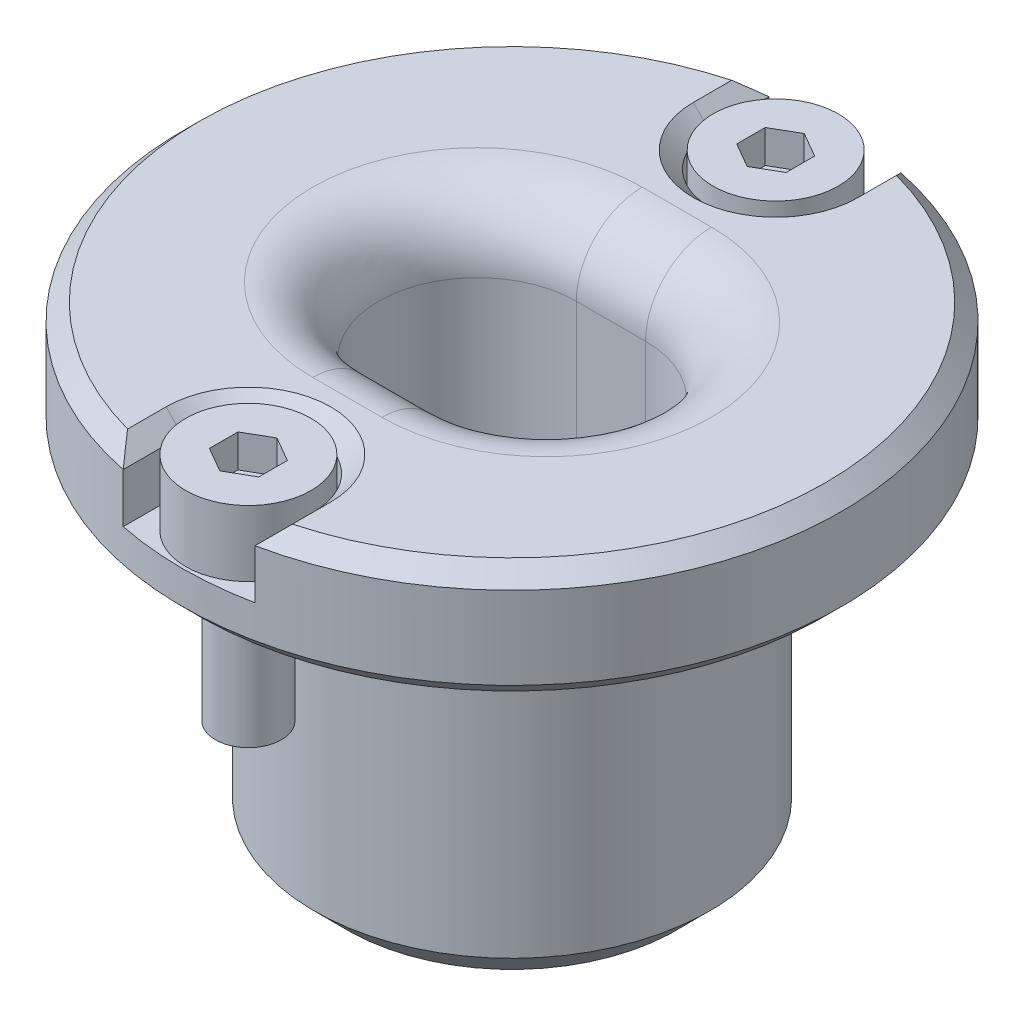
ISO-10303-21;
HEADER;
FILE_DESCRIPTION(('STEP AP214'),'2;1');
FILE_NAME('part.step','',(''),(''),'','','');
FILE_SCHEMA(('AUTOMOTIVE_DESIGN { 1 0 10303 214 1 1 1 1 }'));
ENDSEC;
DATA;
#1=APPLICATION_CONTEXT('core data for automotive mechanical design processes');
#2=APPLICATION_PROTOCOL_DEFINITION('international standard','automotive_design',2000,#1);
#3=PRODUCT_CONTEXT('',#1,'mechanical');
#4=PRODUCT('Part','Part','',(#3));
#5=PRODUCT_RELATED_PRODUCT_CATEGORY('part','',(#4));
#6=PRODUCT_DEFINITION_FORMATION('','',#4);
#7=PRODUCT_DEFINITION_CONTEXT('part definition',#1,'design');
#8=PRODUCT_DEFINITION('design','',#6,#7);
#9=PRODUCT_DEFINITION_SHAPE('','',#8);
#10=(LENGTH_UNIT() NAMED_UNIT(*) SI_UNIT(.MILLI.,.METRE.));
#11=(NAMED_UNIT(*) PLANE_ANGLE_UNIT() SI_UNIT($,.RADIAN.));
#12=(NAMED_UNIT(*) SI_UNIT($,.STERADIAN.) SOLID_ANGLE_UNIT());
#13=UNCERTAINTY_MEASURE_WITH_UNIT(LENGTH_MEASURE(1.E-05),#10,'distance_accuracy_value','');
#14=(GEOMETRIC_REPRESENTATION_CONTEXT(3) GLOBAL_UNCERTAINTY_ASSIGNED_CONTEXT((#13)) GLOBAL_UNIT_ASSIGNED_CONTEXT((#10,
#11,#12)) REPRESENTATION_CONTEXT('',''));
#15=CARTESIAN_POINT('',(0.,0.,0.));
#16=DIRECTION('',(0.,0.,1.));
#17=DIRECTION('',(1.,0.,0.));
#18=AXIS2_PLACEMENT_3D('',#15,#16,#17);
#19=CARTESIAN_POINT('',(4.5,-3.44991936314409,0.));
#20=DIRECTION('',(0.,-1.,0.));
#21=DIRECTION('',(0.,0.,-1.));
#22=AXIS2_PLACEMENT_3D('',#19,#20,#21);
#23=PLANE('',#22);
#24=CARTESIAN_POINT('',(0.,-3.44991936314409,0.));
#25=DIRECTION('',(0.,1.,0.));
#26=DIRECTION('',(0.,0.,1.));
#27=AXIS2_PLACEMENT_3D('',#24,#25,#26);
#28=CIRCLE('',#27,4.5);
#29=CARTESIAN_POINT('',(1.53909064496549,-3.44991936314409,-4.22861679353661));
#30=VERTEX_POINT('',#29);
#31=CARTESIAN_POINT('',(-1.53909064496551,-3.44991936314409,-4.22861679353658));
#32=VERTEX_POINT('',#31);
#33=EDGE_CURVE('E596',#30,#32,#28,.T.);
#34=ORIENTED_EDGE('',*,*,#33,.T.);
#35=DIRECTION('',(-0.342020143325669,0.,-0.939692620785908));
#36=VECTOR('',#35,1.);
#37=CARTESIAN_POINT('',(0.,-3.44991936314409,0.));
#38=LINE('',#37,#36);
#39=CARTESIAN_POINT('',(-1.71010071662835,-3.44991936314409,-4.69846310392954));
#40=VERTEX_POINT('',#39);
#41=EDGE_CURVE('E426',#32,#40,#38,.T.);
#42=ORIENTED_EDGE('',*,*,#41,.T.);
#43=CARTESIAN_POINT('',(0.,-3.44991936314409,0.));
#44=DIRECTION('',(0.,1.,0.));
#45=DIRECTION('',(0.,0.,1.));
#46=AXIS2_PLACEMENT_3D('',#43,#44,#45);
#47=CIRCLE('',#46,5.);
#48=CARTESIAN_POINT('',(1.71010071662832,-3.44991936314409,-4.69846310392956));
#49=VERTEX_POINT('',#48);
#50=EDGE_CURVE('E588',#49,#40,#47,.T.);
#51=ORIENTED_EDGE('',*,*,#50,.F.);
#52=DIRECTION('',(-0.342020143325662,0.,0.939692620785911));
#53=VECTOR('',#52,1.);
#54=CARTESIAN_POINT('',(0.,-3.44991936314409,0.));
#55=LINE('',#54,#53);
#56=EDGE_CURVE('E435',#49,#30,#55,.T.);
#57=ORIENTED_EDGE('',*,*,#56,.T.);
#58=EDGE_LOOP('',(#34,#42,#51,#57));
#59=FACE_BOUND('',#58,.T.);
#60=ADVANCED_FACE('F17',(#59),#23,.T.);
#61=CARTESIAN_POINT('',(4.07688300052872,-3.44991936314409,-1.905));
#62=VERTEX_POINT('',#61);
#63=CARTESIAN_POINT('',(3.15261776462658,-3.44991936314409,-3.21107477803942));
#64=VERTEX_POINT('',#63);
#65=EDGE_CURVE('E592',#62,#64,#28,.T.);
#66=ORIENTED_EDGE('',*,*,#65,.T.);
#67=DIRECTION('',(0.342020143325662,0.,-0.939692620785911));
#68=VECTOR('',#67,1.);
#69=CARTESIAN_POINT('',(1.75181200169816,-3.44991936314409,0.637607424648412));
#70=LINE('',#69,#68);
#71=CARTESIAN_POINT('',(3.18123360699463,-3.44991936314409,-3.28969615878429));
#72=VERTEX_POINT('',#71);
#73=EDGE_CURVE('E383',#64,#72,#70,.T.);
#74=ORIENTED_EDGE('',*,*,#73,.T.);
#75=CARTESIAN_POINT('',(0.,-3.44991936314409,-0.25));
#76=DIRECTION('',(0.,1.,0.));
#77=DIRECTION('',(0.,0.,1.));
#78=AXIS2_PLACEMENT_3D('',#75,#76,#77);
#79=CIRCLE('',#78,4.4);
#80=EDGE_CURVE('E442',#62,#72,#79,.T.);
#81=ORIENTED_EDGE('',*,*,#80,.F.);
#82=EDGE_LOOP('',(#66,#74,#81));
#83=FACE_BOUND('',#82,.T.);
#84=ADVANCED_FACE('F840',(#83),#23,.T.);
#85=CARTESIAN_POINT('',(0.,3.55008063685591,0.));
#86=DIRECTION('',(0.,1.,0.));
#87=DIRECTION('',(0.,0.,1.));
#88=AXIS2_PLACEMENT_3D('',#85,#86,#87);
#89=CYLINDRICAL_SURFACE('',#88,5.);
#90=CARTESIAN_POINT('',(0.,-4.14991936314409,0.));
#91=DIRECTION('',(0.,1.,0.));
#92=DIRECTION('',(0.,0.,1.));
#93=AXIS2_PLACEMENT_3D('',#90,#91,#92);
#94=CIRCLE('',#93,5.);
#95=CARTESIAN_POINT('',(0.,-4.14991936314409,5.));
#96=VERTEX_POINT('',#95);
#97=EDGE_CURVE('E585',#96,#96,#94,.T.);
#98=ORIENTED_EDGE('',*,*,#97,.F.);
#99=EDGE_LOOP('',(#98));
#100=FACE_BOUND('',#99,.T.);
#101=ORIENTED_EDGE('',*,*,#50,.T.);
#102=DIRECTION('',(0.,1.,0.));
#103=VECTOR('',#102,1.);
#104=CARTESIAN_POINT('',(-1.71010071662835,3.55008063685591,-4.69846310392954));
#105=LINE('',#104,#103);
#106=CARTESIAN_POINT('',(-1.71010071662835,-4.04991936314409,-4.69846310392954));
#107=VERTEX_POINT('',#106);
#108=EDGE_CURVE('E26',#40,#107,#105,.F.);
#109=ORIENTED_EDGE('',*,*,#108,.T.);
#110=CARTESIAN_POINT('',(0.,-4.04991936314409,0.));
#111=DIRECTION('',(0.,1.,0.));
#112=DIRECTION('',(0.,0.,1.));
#113=AXIS2_PLACEMENT_3D('',#110,#111,#112);
#114=CIRCLE('',#113,5.);
#115=CARTESIAN_POINT('',(1.71010071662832,-4.04991936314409,-4.69846310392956));
#116=VERTEX_POINT('',#115);
#117=EDGE_CURVE('E784',#107,#116,#114,.T.);
#118=ORIENTED_EDGE('',*,*,#117,.T.);
#119=DIRECTION('',(0.,1.,0.));
#120=VECTOR('',#119,1.);
#121=CARTESIAN_POINT('',(1.71010071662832,3.55008063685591,-4.69846310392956));
#122=LINE('',#121,#120);
#123=EDGE_CURVE('E795',#116,#49,#122,.T.);
#124=ORIENTED_EDGE('',*,*,#123,.T.);
#125=EDGE_LOOP('',(#101,#109,#118,#124));
#126=FACE_BOUND('',#125,.T.);
#127=ADVANCED_FACE('F799',(#100,#126),#89,.F.);
#128=CARTESIAN_POINT('',(0.,-6.94991936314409,0.));
#129=DIRECTION('',(0.,-1.,0.));
#130=DIRECTION('',(1.,0.,0.));
#131=AXIS2_PLACEMENT_3D('',#128,#129,#130);
#132=CYLINDRICAL_SURFACE('',#131,10.);
#133=CARTESIAN_POINT('',(0.,4.0500806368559,0.));
#134=DIRECTION('',(0.,1.,0.));
#135=DIRECTION('',(-1.,0.,0.));
#136=AXIS2_PLACEMENT_3D('',#133,#134,#135);
#137=CIRCLE('',#136,10.);
#138=CARTESIAN_POINT('',(-10.,4.0500806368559,0.));
#139=VERTEX_POINT('',#138);
#140=EDGE_CURVE('E651',#139,#139,#137,.T.);
#141=ORIENTED_EDGE('',*,*,#140,.T.);
#142=EDGE_LOOP('',(#141));
#143=FACE_BOUND('',#142,.T.);
#144=DIRECTION('',(0.,1.,0.));
#145=VECTOR('',#144,1.);
#146=CARTESIAN_POINT('',(2.,5.05008063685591,-9.79795897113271));
#147=LINE('',#146,#145);
#148=CARTESIAN_POINT('',(2.,5.05008063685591,-9.79795897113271));
#149=VERTEX_POINT('',#148);
#150=CARTESIAN_POINT('',(2.,6.55008063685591,-9.79795897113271));
#151=VERTEX_POINT('',#150);
#152=EDGE_CURVE('E543',#149,#151,#147,.T.);
#153=ORIENTED_EDGE('',*,*,#152,.T.);
#154=CARTESIAN_POINT('',(0.,6.55008063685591,0.));
#155=DIRECTION('',(0.,-1.,0.));
#156=DIRECTION('',(1.,0.,0.));
#157=AXIS2_PLACEMENT_3D('',#154,#155,#156);
#158=CIRCLE('',#157,10.);
#159=CARTESIAN_POINT('',(2.,6.55008063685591,9.79795897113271));
#160=VERTEX_POINT('',#159);
#161=EDGE_CURVE('E656',#151,#160,#158,.T.);
#162=ORIENTED_EDGE('',*,*,#161,.T.);
#163=DIRECTION('',(0.,1.,0.));
#164=VECTOR('',#163,1.);
#165=CARTESIAN_POINT('',(2.,5.05008063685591,9.79795897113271));
#166=LINE('',#165,#164);
#167=CARTESIAN_POINT('',(2.,5.05008063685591,9.79795897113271));
#168=VERTEX_POINT('',#167);
#169=EDGE_CURVE('E566',#168,#160,#166,.T.);
#170=ORIENTED_EDGE('',*,*,#169,.F.);
#171=CARTESIAN_POINT('',(0.,5.05008063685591,0.));
#172=DIRECTION('',(0.,1.,0.));
#173=DIRECTION('',(0.,0.,1.));
#174=AXIS2_PLACEMENT_3D('',#171,#172,#173);
#175=CIRCLE('',#174,10.);
#176=CARTESIAN_POINT('',(-2.,5.05008063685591,9.79795897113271));
#177=VERTEX_POINT('',#176);
#178=EDGE_CURVE('E558',#177,#168,#175,.T.);
#179=ORIENTED_EDGE('',*,*,#178,.F.);
#180=DIRECTION('',(0.,1.,0.));
#181=VECTOR('',#180,1.);
#182=CARTESIAN_POINT('',(-2.,5.05008063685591,9.79795897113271));
#183=LINE('',#182,#181);
#184=CARTESIAN_POINT('',(-2.,6.55008063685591,9.79795897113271));
#185=VERTEX_POINT('',#184);
#186=EDGE_CURVE('E569',#177,#185,#183,.T.);
#187=ORIENTED_EDGE('',*,*,#186,.T.);
#188=CARTESIAN_POINT('',(0.,6.55008063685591,0.));
#189=DIRECTION('',(0.,-1.,0.));
#190=DIRECTION('',(1.,0.,0.));
#191=AXIS2_PLACEMENT_3D('',#188,#189,#190);
#192=CIRCLE('',#191,10.);
#193=CARTESIAN_POINT('',(-2.,6.55008063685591,-9.79795897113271));
#194=VERTEX_POINT('',#193);
#195=EDGE_CURVE('E654',#185,#194,#192,.T.);
#196=ORIENTED_EDGE('',*,*,#195,.T.);
#197=DIRECTION('',(0.,1.,0.));
#198=VECTOR('',#197,1.);
#199=CARTESIAN_POINT('',(-2.,5.05008063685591,-9.79795897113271));
#200=LINE('',#199,#198);
#201=CARTESIAN_POINT('',(-2.,5.05008063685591,-9.79795897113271));
#202=VERTEX_POINT('',#201);
#203=EDGE_CURVE('E540',#202,#194,#200,.T.);
#204=ORIENTED_EDGE('',*,*,#203,.F.);
#205=CARTESIAN_POINT('',(0.,5.05008063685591,0.));
#206=DIRECTION('',(0.,1.,0.));
#207=DIRECTION('',(0.,0.,1.));
#208=AXIS2_PLACEMENT_3D('',#205,#206,#207);
#209=CIRCLE('',#208,10.);
#210=EDGE_CURVE('E530',#149,#202,#209,.T.);
#211=ORIENTED_EDGE('',*,*,#210,.F.);
#212=EDGE_LOOP('',(#153,#162,#170,#179,#187,#196,#204,#211));
#213=FACE_BOUND('',#212,.T.);
#214=ADVANCED_FACE('F1049',(#143,#213),#132,.T.);
#215=CARTESIAN_POINT('',(0.,7.05008063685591,0.));
#216=DIRECTION('',(0.,-1.,0.));
#217=DIRECTION('',(1.,0.,0.));
#218=AXIS2_PLACEMENT_3D('',#215,#216,#217);
#219=PLANE('',#218);
#220=CARTESIAN_POINT('',(1.05,7.05008063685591,0.));
#221=DIRECTION('',(0.,-1.,0.));
#222=DIRECTION('',(1.,0.,0.));
#223=AXIS2_PLACEMENT_3D('',#220,#221,#222);
#224=CIRCLE('',#223,5.);
#225=CARTESIAN_POINT('',(1.05,7.05008063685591,-5.));
#226=VERTEX_POINT('',#225);
#227=CARTESIAN_POINT('',(1.05,7.05008063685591,5.));
#228=VERTEX_POINT('',#227);
#229=EDGE_CURVE('E770',#226,#228,#224,.T.);
#230=ORIENTED_EDGE('',*,*,#229,.T.);
#231=DIRECTION('',(1.,0.,0.));
#232=VECTOR('',#231,1.);
#233=CARTESIAN_POINT('',(0.,7.05008063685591,5.));
#234=LINE('',#233,#232);
#235=CARTESIAN_POINT('',(-1.05,7.05008063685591,5.));
#236=VERTEX_POINT('',#235);
#237=EDGE_CURVE('E776',#228,#236,#234,.F.);
#238=ORIENTED_EDGE('',*,*,#237,.T.);
#239=CARTESIAN_POINT('',(-1.05,7.05008063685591,0.));
#240=DIRECTION('',(0.,-1.,0.));
#241=DIRECTION('',(1.,0.,0.));
#242=AXIS2_PLACEMENT_3D('',#239,#240,#241);
#243=CIRCLE('',#242,5.);
#244=CARTESIAN_POINT('',(-1.05,7.05008063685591,-5.));
#245=VERTEX_POINT('',#244);
#246=EDGE_CURVE('E774',#236,#245,#243,.T.);
#247=ORIENTED_EDGE('',*,*,#246,.T.);
#248=DIRECTION('',(-1.,0.,0.));
#249=VECTOR('',#248,1.);
#250=CARTESIAN_POINT('',(0.,7.05008063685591,-5.));
#251=LINE('',#250,#249);
#252=EDGE_CURVE('E772',#245,#226,#251,.F.);
#253=ORIENTED_EDGE('',*,*,#252,.T.);
#254=EDGE_LOOP('',(#230,#238,#247,#253));
#255=FACE_BOUND('',#254,.T.);
#256=DIRECTION('',(0.,0.,1.));
#257=VECTOR('',#256,1.);
#258=CARTESIAN_POINT('',(2.5,7.05008063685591,9.79795897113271));
#259=LINE('',#258,#257);
#260=CARTESIAN_POINT('',(2.5,7.05008063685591,8.));
#261=VERTEX_POINT('',#260);
#262=CARTESIAN_POINT('',(2.5,7.05008063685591,9.16515138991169));
#263=VERTEX_POINT('',#262);
#264=EDGE_CURVE('E630',#261,#263,#259,.T.);
#265=ORIENTED_EDGE('',*,*,#264,.T.);
#266=CARTESIAN_POINT('',(0.,7.05008063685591,0.));
#267=DIRECTION('',(0.,-1.,0.));
#268=DIRECTION('',(1.,0.,0.));
#269=AXIS2_PLACEMENT_3D('',#266,#267,#268);
#270=CIRCLE('',#269,9.5);
#271=CARTESIAN_POINT('',(2.5,7.05008063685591,-9.16515138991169));
#272=VERTEX_POINT('',#271);
#273=EDGE_CURVE('E636',#263,#272,#270,.F.);
#274=ORIENTED_EDGE('',*,*,#273,.T.);
#275=DIRECTION('',(0.,0.,1.));
#276=VECTOR('',#275,1.);
#277=CARTESIAN_POINT('',(2.5,7.05008063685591,0.));
#278=LINE('',#277,#276);
#279=CARTESIAN_POINT('',(2.5,7.05008063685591,-8.));
#280=VERTEX_POINT('',#279);
#281=EDGE_CURVE('E634',#272,#280,#278,.T.);
#282=ORIENTED_EDGE('',*,*,#281,.T.);
#283=CARTESIAN_POINT('',(0.,7.05008063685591,-8.));
#284=DIRECTION('',(0.,-1.,0.));
#285=DIRECTION('',(1.,0.,0.));
#286=AXIS2_PLACEMENT_3D('',#283,#284,#285);
#287=CIRCLE('',#286,2.5);
#288=CARTESIAN_POINT('',(-2.5,7.05008063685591,-8.));
#289=VERTEX_POINT('',#288);
#290=EDGE_CURVE('E632',#280,#289,#287,.T.);
#291=ORIENTED_EDGE('',*,*,#290,.T.);
#292=DIRECTION('',(0.,0.,-1.));
#293=VECTOR('',#292,1.);
#294=CARTESIAN_POINT('',(-2.5,7.05008063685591,-9.79795897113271));
#295=LINE('',#294,#293);
#296=CARTESIAN_POINT('',(-2.5,7.05008063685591,-9.16515138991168));
#297=VERTEX_POINT('',#296);
#298=EDGE_CURVE('E625',#289,#297,#295,.T.);
#299=ORIENTED_EDGE('',*,*,#298,.T.);
#300=CARTESIAN_POINT('',(0.,7.05008063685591,0.));
#301=DIRECTION('',(0.,-1.,0.));
#302=DIRECTION('',(1.,0.,0.));
#303=AXIS2_PLACEMENT_3D('',#300,#301,#302);
#304=CIRCLE('',#303,9.5);
#305=CARTESIAN_POINT('',(-2.5,7.05008063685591,9.16515138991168));
#306=VERTEX_POINT('',#305);
#307=EDGE_CURVE('E615',#297,#306,#304,.F.);
#308=ORIENTED_EDGE('',*,*,#307,.T.);
#309=DIRECTION('',(0.,0.,-1.));
#310=VECTOR('',#309,1.);
#311=CARTESIAN_POINT('',(-2.5,7.05008063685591,0.));
#312=LINE('',#311,#310);
#313=CARTESIAN_POINT('',(-2.5,7.05008063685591,8.));
#314=VERTEX_POINT('',#313);
#315=EDGE_CURVE('E623',#306,#314,#312,.T.);
#316=ORIENTED_EDGE('',*,*,#315,.T.);
#317=CARTESIAN_POINT('',(0.,7.05008063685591,8.));
#318=DIRECTION('',(0.,-1.,0.));
#319=DIRECTION('',(1.,0.,0.));
#320=AXIS2_PLACEMENT_3D('',#317,#318,#319);
#321=CIRCLE('',#320,2.5);
#322=EDGE_CURVE('E628',#314,#261,#321,.T.);
#323=ORIENTED_EDGE('',*,*,#322,.T.);
#324=EDGE_LOOP('',(#265,#274,#282,#291,#299,#308,#316,#323));
#325=FACE_BOUND('',#324,.T.);
#326=ADVANCED_FACE('F1044',(#255,#325),#219,.F.);
#327=CARTESIAN_POINT('',(0.,-6.94991936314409,8.));
#328=DIRECTION('',(0.,1.,0.));
#329=DIRECTION('',(0.,0.,1.));
#330=AXIS2_PLACEMENT_3D('',#327,#328,#329);
#331=CYLINDRICAL_SURFACE('',#330,1.2);
#332=CARTESIAN_POINT('',(0.,3.55008063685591,8.));
#333=DIRECTION('',(0.,1.,0.));
#334=DIRECTION('',(-1.,0.,0.));
#335=AXIS2_PLACEMENT_3D('',#332,#333,#334);
#336=CIRCLE('',#335,1.2);
#337=CARTESIAN_POINT('',(-1.2,3.55008063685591,8.));
#338=VERTEX_POINT('',#337);
#339=EDGE_CURVE('E539',#338,#338,#336,.T.);
#340=ORIENTED_EDGE('',*,*,#339,.F.);
#341=EDGE_LOOP('',(#340));
#342=FACE_BOUND('',#341,.T.);
#343=CARTESIAN_POINT('',(0.,5.05008063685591,8.));
#344=DIRECTION('',(0.,1.,0.));
#345=DIRECTION('',(0.,0.,1.));
#346=AXIS2_PLACEMENT_3D('',#343,#344,#345);
#347=CIRCLE('',#346,1.2);
#348=CARTESIAN_POINT('',(0.,5.05008063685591,9.2));
#349=VERTEX_POINT('',#348);
#350=EDGE_CURVE('E548',#349,#349,#347,.F.);
#351=ORIENTED_EDGE('',*,*,#350,.F.);
#352=EDGE_LOOP('',(#351));
#353=FACE_BOUND('',#352,.T.);
#354=ADVANCED_FACE('F1040',(#342,#353),#331,.F.);
#355=CARTESIAN_POINT('',(0.,-6.94991936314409,-8.));
#356=DIRECTION('',(0.,1.,0.));
#357=DIRECTION('',(0.,0.,1.));
#358=AXIS2_PLACEMENT_3D('',#355,#356,#357);
#359=CYLINDRICAL_SURFACE('',#358,1.2);
#360=CARTESIAN_POINT('',(0.,3.55008063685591,-8.));
#361=DIRECTION('',(0.,1.,0.));
#362=DIRECTION('',(-1.,0.,0.));
#363=AXIS2_PLACEMENT_3D('',#360,#361,#362);
#364=CIRCLE('',#363,1.2);
#365=CARTESIAN_POINT('',(-1.2,3.55008063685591,-8.));
#366=VERTEX_POINT('',#365);
#367=EDGE_CURVE('E576',#366,#366,#364,.T.);
#368=ORIENTED_EDGE('',*,*,#367,.F.);
#369=EDGE_LOOP('',(#368));
#370=FACE_BOUND('',#369,.T.);
#371=CARTESIAN_POINT('',(0.,5.05008063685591,-8.));
#372=DIRECTION('',(0.,1.,0.));
#373=DIRECTION('',(0.,0.,1.));
#374=AXIS2_PLACEMENT_3D('',#371,#372,#373);
#375=CIRCLE('',#374,1.2);
#376=CARTESIAN_POINT('',(0.,5.05008063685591,-6.8));
#377=VERTEX_POINT('',#376);
#378=EDGE_CURVE('E520',#377,#377,#375,.F.);
#379=ORIENTED_EDGE('',*,*,#378,.F.);
#380=EDGE_LOOP('',(#379));
#381=FACE_BOUND('',#380,.T.);
#382=ADVANCED_FACE('F1036',(#370,#381),#359,.F.);
#383=CARTESIAN_POINT('',(0.,-6.94991936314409,0.));
#384=DIRECTION('',(0.,1.,0.));
#385=DIRECTION('',(-1.,0.,0.));
#386=AXIS2_PLACEMENT_3D('',#383,#384,#385);
#387=PLANE('',#386);
#388=CARTESIAN_POINT('',(0.,-6.94991936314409,0.));
#389=DIRECTION('',(0.,1.,0.));
#390=DIRECTION('',(-1.,0.,0.));
#391=AXIS2_PLACEMENT_3D('',#388,#389,#390);
#392=CIRCLE('',#391,5.);
#393=CARTESIAN_POINT('',(-5.,-6.94991936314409,0.));
#394=VERTEX_POINT('',#393);
#395=EDGE_CURVE('E761',#394,#394,#392,.F.);
#396=ORIENTED_EDGE('',*,*,#395,.T.);
#397=EDGE_LOOP('',(#396));
#398=FACE_BOUND('',#397,.T.);
#399=CARTESIAN_POINT('',(0.,-6.94991936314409,0.));
#400=DIRECTION('',(0.,1.,0.));
#401=DIRECTION('',(0.,0.,1.));
#402=AXIS2_PLACEMENT_3D('',#399,#400,#401);
#403=CIRCLE('',#402,4.75);
#404=CARTESIAN_POINT('',(0.,-6.94991936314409,4.75));
#405=VERTEX_POINT('',#404);
#406=EDGE_CURVE('E579',#405,#405,#403,.T.);
#407=ORIENTED_EDGE('',*,*,#406,.T.);
#408=EDGE_LOOP('',(#407));
#409=FACE_BOUND('',#408,.T.);
#410=ADVANCED_FACE('F1039',(#398,#409),#387,.F.);
#411=CARTESIAN_POINT('',(0.,-6.94991936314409,0.));
#412=DIRECTION('',(0.,-1.,0.));
#413=DIRECTION('',(1.,0.,0.));
#414=AXIS2_PLACEMENT_3D('',#411,#412,#413);
#415=CYLINDRICAL_SURFACE('',#414,6.);
#416=CARTESIAN_POINT('',(0.,-5.94991936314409,0.));
#417=DIRECTION('',(0.,1.,0.));
#418=DIRECTION('',(-1.,0.,0.));
#419=AXIS2_PLACEMENT_3D('',#416,#417,#418);
#420=CIRCLE('',#419,6.);
#421=CARTESIAN_POINT('',(-6.,-5.94991936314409,0.));
#422=VERTEX_POINT('',#421);
#423=EDGE_CURVE('E764',#422,#422,#420,.T.);
#424=ORIENTED_EDGE('',*,*,#423,.T.);
#425=EDGE_LOOP('',(#424));
#426=FACE_BOUND('',#425,.T.);
#427=CARTESIAN_POINT('',(0.,3.15008063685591,0.));
#428=DIRECTION('',(0.,1.,0.));
#429=DIRECTION('',(-1.,0.,0.));
#430=AXIS2_PLACEMENT_3D('',#427,#428,#429);
#431=CIRCLE('',#430,6.);
#432=CARTESIAN_POINT('',(-6.,3.15008063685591,0.));
#433=VERTEX_POINT('',#432);
#434=EDGE_CURVE('E661',#433,#433,#431,.F.);
#435=ORIENTED_EDGE('',*,*,#434,.T.);
#436=EDGE_LOOP('',(#435));
#437=FACE_BOUND('',#436,.T.);
#438=ADVANCED_FACE('F1064',(#426,#437),#415,.T.);
#439=CARTESIAN_POINT('',(0.,3.55008063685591,0.));
#440=DIRECTION('',(0.,1.,0.));
#441=DIRECTION('',(-1.,0.,0.));
#442=AXIS2_PLACEMENT_3D('',#439,#440,#441);
#443=PLANE('',#442);
#444=CARTESIAN_POINT('',(0.,3.55008063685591,0.));
#445=DIRECTION('',(0.,1.,0.));
#446=DIRECTION('',(-1.,0.,0.));
#447=AXIS2_PLACEMENT_3D('',#444,#445,#446);
#448=CIRCLE('',#447,6.4);
#449=CARTESIAN_POINT('',(-6.4,3.55008063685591,0.));
#450=VERTEX_POINT('',#449);
#451=EDGE_CURVE('E758',#450,#450,#448,.T.);
#452=ORIENTED_EDGE('',*,*,#451,.T.);
#453=EDGE_LOOP('',(#452));
#454=FACE_BOUND('',#453,.T.);
#455=CARTESIAN_POINT('',(0.,3.55008063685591,0.));
#456=DIRECTION('',(0.,1.,0.));
#457=DIRECTION('',(-1.,0.,0.));
#458=AXIS2_PLACEMENT_3D('',#455,#456,#457);
#459=CIRCLE('',#458,9.5);
#460=CARTESIAN_POINT('',(-9.5,3.55008063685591,0.));
#461=VERTEX_POINT('',#460);
#462=EDGE_CURVE('E658',#461,#461,#459,.F.);
#463=ORIENTED_EDGE('',*,*,#462,.T.);
#464=EDGE_LOOP('',(#463));
#465=FACE_BOUND('',#464,.T.);
#466=ORIENTED_EDGE('',*,*,#367,.T.);
#467=EDGE_LOOP('',(#466));
#468=FACE_BOUND('',#467,.T.);
#469=ORIENTED_EDGE('',*,*,#339,.T.);
#470=EDGE_LOOP('',(#469));
#471=FACE_BOUND('',#470,.T.);
#472=ADVANCED_FACE('F1070',(#454,#465,#468,#471),#443,.F.);
#473=CARTESIAN_POINT('',(-1.05,0.55008063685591,0.));
#474=DIRECTION('',(0.,1.,0.));
#475=DIRECTION('',(0.,0.,1.));
#476=AXIS2_PLACEMENT_3D('',#473,#474,#475);
#477=CYLINDRICAL_SURFACE('',#476,3.);
#478=DIRECTION('',(0.,1.,0.));
#479=VECTOR('',#478,1.);
#480=CARTESIAN_POINT('',(-1.05,0.55008063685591,-3.));
#481=LINE('',#480,#479);
#482=CARTESIAN_POINT('',(-1.05,0.55008063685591,-3.));
#483=VERTEX_POINT('',#482);
#484=CARTESIAN_POINT('',(-1.05,5.05008063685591,-3.));
#485=VERTEX_POINT('',#484);
#486=EDGE_CURVE('E612',#483,#485,#481,.T.);
#487=ORIENTED_EDGE('',*,*,#486,.T.);
#488=CARTESIAN_POINT('',(-1.05,5.05008063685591,0.));
#489=DIRECTION('',(0.,-1.,0.));
#490=DIRECTION('',(1.,0.,0.));
#491=AXIS2_PLACEMENT_3D('',#488,#489,#490);
#492=CIRCLE('',#491,3.);
#493=CARTESIAN_POINT('',(-1.05,5.05008063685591,3.));
#494=VERTEX_POINT('',#493);
#495=EDGE_CURVE('E779',#485,#494,#492,.F.);
#496=ORIENTED_EDGE('',*,*,#495,.T.);
#497=DIRECTION('',(0.,1.,0.));
#498=VECTOR('',#497,1.);
#499=CARTESIAN_POINT('',(-1.05,0.55008063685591,3.));
#500=LINE('',#499,#498);
#501=CARTESIAN_POINT('',(-1.05,0.55008063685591,3.));
#502=VERTEX_POINT('',#501);
#503=EDGE_CURVE('E611',#502,#494,#500,.T.);
#504=ORIENTED_EDGE('',*,*,#503,.F.);
#505=CARTESIAN_POINT('',(-1.05,0.55008063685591,0.));
#506=DIRECTION('',(0.,1.,0.));
#507=DIRECTION('',(0.,0.,1.));
#508=AXIS2_PLACEMENT_3D('',#505,#506,#507);
#509=CIRCLE('',#508,3.);
#510=EDGE_CURVE('E599',#483,#502,#509,.T.);
#511=ORIENTED_EDGE('',*,*,#510,.F.);
#512=EDGE_LOOP('',(#487,#496,#504,#511));
#513=FACE_BOUND('',#512,.T.);
#514=ADVANCED_FACE('F1075',(#513),#477,.F.);
#515=CARTESIAN_POINT('',(-1.05,0.55008063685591,-3.));
#516=DIRECTION('',(0.,0.,-1.));
#517=DIRECTION('',(-1.,0.,0.));
#518=AXIS2_PLACEMENT_3D('',#515,#516,#517);
#519=PLANE('',#518);
#520=DIRECTION('',(0.,1.,0.));
#521=VECTOR('',#520,1.);
#522=CARTESIAN_POINT('',(1.05,0.55008063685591,-3.));
#523=LINE('',#522,#521);
#524=CARTESIAN_POINT('',(1.05,0.55008063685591,-3.));
#525=VERTEX_POINT('',#524);
#526=CARTESIAN_POINT('',(1.05,5.05008063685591,-3.));
#527=VERTEX_POINT('',#526);
#528=EDGE_CURVE('E616',#525,#527,#523,.T.);
#529=ORIENTED_EDGE('',*,*,#528,.T.);
#530=DIRECTION('',(-1.,0.,0.));
#531=VECTOR('',#530,1.);
#532=CARTESIAN_POINT('',(-1.05,5.05008063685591,-3.));
#533=LINE('',#532,#531);
#534=EDGE_CURVE('E781',#527,#485,#533,.T.);
#535=ORIENTED_EDGE('',*,*,#534,.T.);
#536=ORIENTED_EDGE('',*,*,#486,.F.);
#537=DIRECTION('',(-1.,0.,0.));
#538=VECTOR('',#537,1.);
#539=CARTESIAN_POINT('',(-1.05,0.55008063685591,-3.));
#540=LINE('',#539,#538);
#541=EDGE_CURVE('E608',#525,#483,#540,.T.);
#542=ORIENTED_EDGE('',*,*,#541,.F.);
#543=EDGE_LOOP('',(#529,#535,#536,#542));
#544=FACE_BOUND('',#543,.T.);
#545=ADVANCED_FACE('F1082',(#544),#519,.F.);
#546=CARTESIAN_POINT('',(1.05,0.55008063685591,0.));
#547=DIRECTION('',(0.,1.,0.));
#548=DIRECTION('',(0.,0.,1.));
#549=AXIS2_PLACEMENT_3D('',#546,#547,#548);
#550=CYLINDRICAL_SURFACE('',#549,3.);
#551=DIRECTION('',(0.,1.,0.));
#552=VECTOR('',#551,1.);
#553=CARTESIAN_POINT('',(1.05,0.55008063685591,3.));
#554=LINE('',#553,#552);
#555=CARTESIAN_POINT('',(1.05,0.55008063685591,3.));
#556=VERTEX_POINT('',#555);
#557=CARTESIAN_POINT('',(1.05,5.05008063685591,3.));
#558=VERTEX_POINT('',#557);
#559=EDGE_CURVE('E618',#556,#558,#554,.T.);
#560=ORIENTED_EDGE('',*,*,#559,.T.);
#561=CARTESIAN_POINT('',(1.05,5.05008063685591,0.));
#562=DIRECTION('',(0.,-1.,0.));
#563=DIRECTION('',(1.,0.,0.));
#564=AXIS2_PLACEMENT_3D('',#561,#562,#563);
#565=CIRCLE('',#564,3.);
#566=EDGE_CURVE('E41',#558,#527,#565,.F.);
#567=ORIENTED_EDGE('',*,*,#566,.T.);
#568=ORIENTED_EDGE('',*,*,#528,.F.);
#569=CARTESIAN_POINT('',(1.05,0.55008063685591,0.));
#570=DIRECTION('',(0.,1.,0.));
#571=DIRECTION('',(0.,0.,1.));
#572=AXIS2_PLACEMENT_3D('',#569,#570,#571);
#573=CIRCLE('',#572,3.);
#574=EDGE_CURVE('E605',#556,#525,#573,.T.);
#575=ORIENTED_EDGE('',*,*,#574,.F.);
#576=EDGE_LOOP('',(#560,#567,#568,#575));
#577=FACE_BOUND('',#576,.T.);
#578=ADVANCED_FACE('F924',(#577),#550,.F.);
#579=CARTESIAN_POINT('',(-1.05,0.55008063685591,3.));
#580=DIRECTION('',(0.,0.,1.));
#581=DIRECTION('',(1.,0.,0.));
#582=AXIS2_PLACEMENT_3D('',#579,#580,#581);
#583=PLANE('',#582);
#584=ORIENTED_EDGE('',*,*,#503,.T.);
#585=DIRECTION('',(1.,0.,0.));
#586=VECTOR('',#585,1.);
#587=CARTESIAN_POINT('',(-1.05,5.05008063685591,3.));
#588=LINE('',#587,#586);
#589=EDGE_CURVE('E767',#494,#558,#588,.T.);
#590=ORIENTED_EDGE('',*,*,#589,.T.);
#591=ORIENTED_EDGE('',*,*,#559,.F.);
#592=DIRECTION('',(1.,0.,0.));
#593=VECTOR('',#592,1.);
#594=CARTESIAN_POINT('',(-1.05,0.55008063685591,3.));
#595=LINE('',#594,#593);
#596=EDGE_CURVE('E602',#502,#556,#595,.T.);
#597=ORIENTED_EDGE('',*,*,#596,.F.);
#598=EDGE_LOOP('',(#584,#590,#591,#597));
#599=FACE_BOUND('',#598,.T.);
#600=ADVANCED_FACE('F917',(#599),#583,.F.);
#601=CARTESIAN_POINT('',(0.,3.55008063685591,0.));
#602=DIRECTION('',(0.,1.,0.));
#603=DIRECTION('',(0.,0.,1.));
#604=AXIS2_PLACEMENT_3D('',#601,#602,#603);
#605=CYLINDRICAL_SURFACE('',#604,4.5);
#606=CARTESIAN_POINT('',(0.,-3.24991936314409,0.));
#607=DIRECTION('',(0.,1.,0.));
#608=DIRECTION('',(0.,0.,1.));
#609=AXIS2_PLACEMENT_3D('',#606,#607,#608);
#610=CIRCLE('',#609,4.5);
#611=CARTESIAN_POINT('',(0.,-3.24991936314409,4.5));
#612=VERTEX_POINT('',#611);
#613=EDGE_CURVE('E10',#612,#612,#610,.F.);
#614=ORIENTED_EDGE('',*,*,#613,.F.);
#615=EDGE_LOOP('',(#614));
#616=FACE_BOUND('',#615,.T.);
#617=ORIENTED_EDGE('',*,*,#65,.F.);
#618=CARTESIAN_POINT('',(-4.07688300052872,-3.44991936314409,-1.905));
#619=VERTEX_POINT('',#618);
#620=EDGE_CURVE('E457',#619,#62,#28,.T.);
#621=ORIENTED_EDGE('',*,*,#620,.F.);
#622=CARTESIAN_POINT('',(-3.15261776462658,-3.44991936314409,-3.21107477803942));
#623=VERTEX_POINT('',#622);
#624=EDGE_CURVE('E591',#623,#619,#28,.T.);
#625=ORIENTED_EDGE('',*,*,#624,.F.);
#626=EDGE_CURVE('E816',#32,#623,#28,.T.);
#627=ORIENTED_EDGE('',*,*,#626,.F.);
#628=ORIENTED_EDGE('',*,*,#33,.F.);
#629=EDGE_CURVE('E481',#64,#30,#28,.T.);
#630=ORIENTED_EDGE('',*,*,#629,.F.);
#631=EDGE_LOOP('',(#617,#621,#625,#627,#628,#630));
#632=FACE_BOUND('',#631,.T.);
#633=ADVANCED_FACE('F822',(#616,#632),#605,.F.);
#634=DIRECTION('',(-0.342020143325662,0.,-0.939692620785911));
#635=VECTOR('',#634,1.);
#636=CARTESIAN_POINT('',(-1.75181200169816,-3.44991936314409,0.637607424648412));
#637=LINE('',#636,#635);
#638=CARTESIAN_POINT('',(-3.18123360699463,-3.44991936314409,-3.28969615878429));
#639=VERTEX_POINT('',#638);
#640=EDGE_CURVE('E390',#623,#639,#637,.T.);
#641=ORIENTED_EDGE('',*,*,#640,.F.);
#642=ORIENTED_EDGE('',*,*,#624,.T.);
#643=EDGE_CURVE('E423',#639,#619,#79,.T.);
#644=ORIENTED_EDGE('',*,*,#643,.F.);
#645=EDGE_LOOP('',(#641,#642,#644));
#646=FACE_BOUND('',#645,.T.);
#647=ADVANCED_FACE('F899',(#646),#23,.T.);
#648=CARTESIAN_POINT('',(5.,-4.14991936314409,0.));
#649=DIRECTION('',(0.,1.,0.));
#650=DIRECTION('',(0.,0.,1.));
#651=AXIS2_PLACEMENT_3D('',#648,#649,#650);
#652=PLANE('',#651);
#653=ORIENTED_EDGE('',*,*,#97,.T.);
#654=EDGE_LOOP('',(#653));
#655=FACE_BOUND('',#654,.T.);
#656=CARTESIAN_POINT('',(0.,-4.14991936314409,0.));
#657=DIRECTION('',(0.,1.,0.));
#658=DIRECTION('',(0.,0.,1.));
#659=AXIS2_PLACEMENT_3D('',#656,#657,#658);
#660=CIRCLE('',#659,4.75);
#661=CARTESIAN_POINT('',(0.,-4.14991936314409,4.75));
#662=VERTEX_POINT('',#661);
#663=EDGE_CURVE('E582',#662,#662,#660,.T.);
#664=ORIENTED_EDGE('',*,*,#663,.F.);
#665=EDGE_LOOP('',(#664));
#666=FACE_BOUND('',#665,.T.);
#667=ADVANCED_FACE('F907',(#655,#666),#652,.T.);
#668=CARTESIAN_POINT('',(0.,3.55008063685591,0.));
#669=DIRECTION('',(0.,1.,0.));
#670=DIRECTION('',(0.,0.,1.));
#671=AXIS2_PLACEMENT_3D('',#668,#669,#670);
#672=CYLINDRICAL_SURFACE('',#671,4.75);
#673=ORIENTED_EDGE('',*,*,#663,.T.);
#674=EDGE_LOOP('',(#673));
#675=FACE_BOUND('',#674,.T.);
#676=ORIENTED_EDGE('',*,*,#406,.F.);
#677=EDGE_LOOP('',(#676));
#678=FACE_BOUND('',#677,.T.);
#679=ADVANCED_FACE('F914',(#675,#678),#672,.F.);
#680=CARTESIAN_POINT('',(0.,5.05008063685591,-8.));
#681=DIRECTION('',(0.,1.,0.));
#682=DIRECTION('',(0.,0.,1.));
#683=AXIS2_PLACEMENT_3D('',#680,#681,#682);
#684=CYLINDRICAL_SURFACE('',#683,2.);
#685=DIRECTION('',(0.,1.,0.));
#686=VECTOR('',#685,1.);
#687=CARTESIAN_POINT('',(-2.,5.05008063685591,-8.));
#688=LINE('',#687,#686);
#689=CARTESIAN_POINT('',(-2.,5.05008063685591,-8.));
#690=VERTEX_POINT('',#689);
#691=CARTESIAN_POINT('',(-2.,6.55008063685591,-8.));
#692=VERTEX_POINT('',#691);
#693=EDGE_CURVE('E536',#690,#692,#688,.T.);
#694=ORIENTED_EDGE('',*,*,#693,.T.);
#695=CARTESIAN_POINT('',(0.,6.55008063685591,-8.));
#696=DIRECTION('',(0.,-1.,0.));
#697=DIRECTION('',(0.,0.,-1.));
#698=AXIS2_PLACEMENT_3D('',#695,#696,#697);
#699=CIRCLE('',#698,2.);
#700=CARTESIAN_POINT('',(2.,6.55008063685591,-8.));
#701=VERTEX_POINT('',#700);
#702=EDGE_CURVE('E643',#692,#701,#699,.F.);
#703=ORIENTED_EDGE('',*,*,#702,.T.);
#704=DIRECTION('',(0.,1.,0.));
#705=VECTOR('',#704,1.);
#706=CARTESIAN_POINT('',(2.,5.05008063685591,-8.));
#707=LINE('',#706,#705);
#708=CARTESIAN_POINT('',(2.,5.05008063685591,-8.));
#709=VERTEX_POINT('',#708);
#710=EDGE_CURVE('E535',#709,#701,#707,.T.);
#711=ORIENTED_EDGE('',*,*,#710,.F.);
#712=CARTESIAN_POINT('',(0.,5.05008063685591,-8.));
#713=DIRECTION('',(0.,1.,0.));
#714=DIRECTION('',(0.,0.,1.));
#715=AXIS2_PLACEMENT_3D('',#712,#713,#714);
#716=CIRCLE('',#715,2.);
#717=EDGE_CURVE('E523',#690,#709,#716,.T.);
#718=ORIENTED_EDGE('',*,*,#717,.F.);
#719=EDGE_LOOP('',(#694,#703,#711,#718));
#720=FACE_BOUND('',#719,.T.);
#721=ADVANCED_FACE('F1014',(#720),#684,.F.);
#722=CARTESIAN_POINT('',(-2.,5.05008063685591,0.));
#723=DIRECTION('',(1.,0.,0.));
#724=DIRECTION('',(0.,0.,-1.));
#725=AXIS2_PLACEMENT_3D('',#722,#723,#724);
#726=PLANE('',#725);
#727=ORIENTED_EDGE('',*,*,#203,.T.);
#728=DIRECTION('',(0.,0.,1.));
#729=VECTOR('',#728,1.);
#730=CARTESIAN_POINT('',(-2.,6.55008063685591,-8.));
#731=LINE('',#730,#729);
#732=EDGE_CURVE('E638',#194,#692,#731,.T.);
#733=ORIENTED_EDGE('',*,*,#732,.T.);
#734=ORIENTED_EDGE('',*,*,#693,.F.);
#735=DIRECTION('',(0.,0.,-1.));
#736=VECTOR('',#735,1.);
#737=CARTESIAN_POINT('',(-2.,5.05008063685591,0.));
#738=LINE('',#737,#736);
#739=EDGE_CURVE('E533',#690,#202,#738,.T.);
#740=ORIENTED_EDGE('',*,*,#739,.T.);
#741=EDGE_LOOP('',(#727,#733,#734,#740));
#742=FACE_BOUND('',#741,.T.);
#743=ADVANCED_FACE('F1011',(#742),#726,.T.);
#744=CARTESIAN_POINT('',(2.,5.05008063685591,0.));
#745=DIRECTION('',(1.,0.,0.));
#746=DIRECTION('',(0.,0.,-1.));
#747=AXIS2_PLACEMENT_3D('',#744,#745,#746);
#748=PLANE('',#747);
#749=ORIENTED_EDGE('',*,*,#710,.T.);
#750=DIRECTION('',(0.,0.,-1.));
#751=VECTOR('',#750,1.);
#752=CARTESIAN_POINT('',(2.,6.55008063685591,0.));
#753=LINE('',#752,#751);
#754=EDGE_CURVE('E641',#701,#151,#753,.T.);
#755=ORIENTED_EDGE('',*,*,#754,.T.);
#756=ORIENTED_EDGE('',*,*,#152,.F.);
#757=DIRECTION('',(0.,0.,-1.));
#758=VECTOR('',#757,1.);
#759=CARTESIAN_POINT('',(2.,5.05008063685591,0.));
#760=LINE('',#759,#758);
#761=EDGE_CURVE('E527',#709,#149,#760,.T.);
#762=ORIENTED_EDGE('',*,*,#761,.F.);
#763=EDGE_LOOP('',(#749,#755,#756,#762));
#764=FACE_BOUND('',#763,.T.);
#765=ADVANCED_FACE('F1009',(#764),#748,.F.);
#766=CARTESIAN_POINT('',(0.,5.05008063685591,0.));
#767=DIRECTION('',(0.,1.,0.));
#768=DIRECTION('',(0.,0.,1.));
#769=AXIS2_PLACEMENT_3D('',#766,#767,#768);
#770=PLANE('',#769);
#771=CARTESIAN_POINT('',(0.,5.05008063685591,-8.));
#772=DIRECTION('',(0.,1.,0.));
#773=DIRECTION('',(1.,0.,0.));
#774=AXIS2_PLACEMENT_3D('',#771,#772,#773);
#775=CIRCLE('',#774,1.9);
#776=CARTESIAN_POINT('',(1.9,5.05008063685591,-8.));
#777=VERTEX_POINT('',#776);
#778=EDGE_CURVE('E362',#777,#777,#775,.T.);
#779=ORIENTED_EDGE('',*,*,#778,.F.);
#780=EDGE_LOOP('',(#779));
#781=FACE_BOUND('',#780,.T.);
#782=ORIENTED_EDGE('',*,*,#717,.T.);
#783=ORIENTED_EDGE('',*,*,#761,.T.);
#784=ORIENTED_EDGE('',*,*,#210,.T.);
#785=ORIENTED_EDGE('',*,*,#739,.F.);
#786=EDGE_LOOP('',(#782,#783,#784,#785));
#787=FACE_BOUND('',#786,.T.);
#788=ADVANCED_FACE('F1005',(#781,#787),#770,.T.);
#789=CARTESIAN_POINT('',(0.,5.05008063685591,8.));
#790=DIRECTION('',(0.,1.,0.));
#791=DIRECTION('',(0.,0.,1.));
#792=AXIS2_PLACEMENT_3D('',#789,#790,#791);
#793=CYLINDRICAL_SURFACE('',#792,2.);
#794=DIRECTION('',(0.,1.,0.));
#795=VECTOR('',#794,1.);
#796=CARTESIAN_POINT('',(2.,5.05008063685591,8.));
#797=LINE('',#796,#795);
#798=CARTESIAN_POINT('',(2.,5.05008063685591,8.));
#799=VERTEX_POINT('',#798);
#800=CARTESIAN_POINT('',(2.,6.55008063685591,8.));
#801=VERTEX_POINT('',#800);
#802=EDGE_CURVE('E524',#799,#801,#797,.T.);
#803=ORIENTED_EDGE('',*,*,#802,.T.);
#804=CARTESIAN_POINT('',(0.,6.55008063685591,8.));
#805=DIRECTION('',(0.,-1.,0.));
#806=DIRECTION('',(0.,0.,-1.));
#807=AXIS2_PLACEMENT_3D('',#804,#805,#806);
#808=CIRCLE('',#807,2.);
#809=CARTESIAN_POINT('',(-2.,6.55008063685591,8.));
#810=VERTEX_POINT('',#809);
#811=EDGE_CURVE('E649',#801,#810,#808,.F.);
#812=ORIENTED_EDGE('',*,*,#811,.T.);
#813=DIRECTION('',(0.,1.,0.));
#814=VECTOR('',#813,1.);
#815=CARTESIAN_POINT('',(-2.,5.05008063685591,8.));
#816=LINE('',#815,#814);
#817=CARTESIAN_POINT('',(-2.,5.05008063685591,8.));
#818=VERTEX_POINT('',#817);
#819=EDGE_CURVE('E563',#818,#810,#816,.T.);
#820=ORIENTED_EDGE('',*,*,#819,.F.);
#821=CARTESIAN_POINT('',(0.,5.05008063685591,8.));
#822=DIRECTION('',(0.,1.,0.));
#823=DIRECTION('',(0.,0.,1.));
#824=AXIS2_PLACEMENT_3D('',#821,#822,#823);
#825=CIRCLE('',#824,2.);
#826=EDGE_CURVE('E551',#799,#818,#825,.T.);
#827=ORIENTED_EDGE('',*,*,#826,.F.);
#828=EDGE_LOOP('',(#803,#812,#820,#827));
#829=FACE_BOUND('',#828,.T.);
#830=ADVANCED_FACE('F1008',(#829),#793,.F.);
#831=CARTESIAN_POINT('',(2.,5.05008063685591,0.));
#832=DIRECTION('',(-1.,0.,0.));
#833=DIRECTION('',(0.,0.,1.));
#834=AXIS2_PLACEMENT_3D('',#831,#832,#833);
#835=PLANE('',#834);
#836=ORIENTED_EDGE('',*,*,#169,.T.);
#837=DIRECTION('',(0.,0.,-1.));
#838=VECTOR('',#837,1.);
#839=CARTESIAN_POINT('',(2.,6.55008063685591,8.));
#840=LINE('',#839,#838);
#841=EDGE_CURVE('E645',#160,#801,#840,.T.);
#842=ORIENTED_EDGE('',*,*,#841,.T.);
#843=ORIENTED_EDGE('',*,*,#802,.F.);
#844=DIRECTION('',(0.,0.,1.));
#845=VECTOR('',#844,1.);
#846=CARTESIAN_POINT('',(2.,5.05008063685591,0.));
#847=LINE('',#846,#845);
#848=EDGE_CURVE('E561',#799,#168,#847,.T.);
#849=ORIENTED_EDGE('',*,*,#848,.T.);
#850=EDGE_LOOP('',(#836,#842,#843,#849));
#851=FACE_BOUND('',#850,.T.);
#852=ADVANCED_FACE('F1026',(#851),#835,.T.);
#853=CARTESIAN_POINT('',(-2.,5.05008063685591,0.));
#854=DIRECTION('',(-1.,0.,0.));
#855=DIRECTION('',(0.,0.,1.));
#856=AXIS2_PLACEMENT_3D('',#853,#854,#855);
#857=PLANE('',#856);
#858=ORIENTED_EDGE('',*,*,#819,.T.);
#859=DIRECTION('',(0.,0.,1.));
#860=VECTOR('',#859,1.);
#861=CARTESIAN_POINT('',(-2.,6.55008063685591,0.));
#862=LINE('',#861,#860);
#863=EDGE_CURVE('E647',#810,#185,#862,.T.);
#864=ORIENTED_EDGE('',*,*,#863,.T.);
#865=ORIENTED_EDGE('',*,*,#186,.F.);
#866=DIRECTION('',(0.,0.,1.));
#867=VECTOR('',#866,1.);
#868=CARTESIAN_POINT('',(-2.,5.05008063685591,0.));
#869=LINE('',#868,#867);
#870=EDGE_CURVE('E555',#818,#177,#869,.T.);
#871=ORIENTED_EDGE('',*,*,#870,.F.);
#872=EDGE_LOOP('',(#858,#864,#865,#871));
#873=FACE_BOUND('',#872,.T.);
#874=ADVANCED_FACE('F1024',(#873),#857,.F.);
#875=CARTESIAN_POINT('',(0.,5.05008063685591,0.));
#876=DIRECTION('',(0.,1.,0.));
#877=DIRECTION('',(0.,0.,1.));
#878=AXIS2_PLACEMENT_3D('',#875,#876,#877);
#879=PLANE('',#878);
#880=CARTESIAN_POINT('',(0.,5.05008063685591,8.));
#881=DIRECTION('',(0.,1.,0.));
#882=DIRECTION('',(1.,0.,0.));
#883=AXIS2_PLACEMENT_3D('',#880,#881,#882);
#884=CIRCLE('',#883,1.9);
#885=CARTESIAN_POINT('',(1.9,5.05008063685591,8.));
#886=VERTEX_POINT('',#885);
#887=EDGE_CURVE('E511',#886,#886,#884,.T.);
#888=ORIENTED_EDGE('',*,*,#887,.F.);
#889=EDGE_LOOP('',(#888));
#890=FACE_BOUND('',#889,.T.);
#891=ORIENTED_EDGE('',*,*,#826,.T.);
#892=ORIENTED_EDGE('',*,*,#870,.T.);
#893=ORIENTED_EDGE('',*,*,#178,.T.);
#894=ORIENTED_EDGE('',*,*,#848,.F.);
#895=EDGE_LOOP('',(#891,#892,#893,#894));
#896=FACE_BOUND('',#895,.T.);
#897=ADVANCED_FACE('F747',(#890,#896),#879,.T.);
#898=CARTESIAN_POINT('',(2.5,7.05008063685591,0.));
#899=DIRECTION('',(-0.707106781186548,0.707106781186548,0.));
#900=DIRECTION('',(0.,0.,-1.));
#901=AXIS2_PLACEMENT_3D('',#898,#899,#900);
#902=PLANE('',#901);
#903=DIRECTION('',(0.707106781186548,0.707106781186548,0.));
#904=VECTOR('',#903,1.);
#905=CARTESIAN_POINT('',(2.,6.55008063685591,8.));
#906=LINE('',#905,#904);
#907=EDGE_CURVE('E720',#801,#261,#906,.T.);
#908=ORIENTED_EDGE('',*,*,#907,.F.);
#909=ORIENTED_EDGE('',*,*,#841,.F.);
#910=CARTESIAN_POINT('',(2.5,7.05008063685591,9.16515138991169));
#911=CARTESIAN_POINT('',(2.45896572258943,7.00904635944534,9.21887771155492));
#912=CARTESIAN_POINT('',(2.4177651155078,6.96784575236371,9.27234971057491));
#913=CARTESIAN_POINT('',(2.33504595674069,6.8851265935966,9.37879150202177));
#914=CARTESIAN_POINT('',(2.29352742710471,6.84360806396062,9.43176132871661));
#915=CARTESIAN_POINT('',(2.21018168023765,6.76026231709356,9.53721236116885));
#916=CARTESIAN_POINT('',(2.16835446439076,6.71843510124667,9.5896935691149));
#917=CARTESIAN_POINT('',(2.08439931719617,6.63447995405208,9.69418100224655));
#918=CARTESIAN_POINT('',(2.04227136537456,6.59235200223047,9.74618719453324));
#919=CARTESIAN_POINT('',(2.,6.55008063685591,9.79795897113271));
#920=B_SPLINE_CURVE_WITH_KNOTS('',3,(#910,#911,#912,#913,#914,#915,#916,#917,#918,#919),
.UNSPECIFIED.,.F.,.F.,(4,2,2,2,4),(0.,0.237248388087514,0.474480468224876,0.711711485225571,
0.948958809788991),.UNSPECIFIED.);
#921=EDGE_CURVE('E552',#263,#160,#920,.T.);
#922=ORIENTED_EDGE('',*,*,#921,.F.);
#923=ORIENTED_EDGE('',*,*,#264,.F.);
#924=EDGE_LOOP('',(#908,#909,#922,#923));
#925=FACE_BOUND('',#924,.T.);
#926=ADVANCED_FACE('F740',(#925),#902,.T.);
#927=CARTESIAN_POINT('',(0.,6.55008063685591,0.));
#928=DIRECTION('',(0.,-1.,0.));
#929=DIRECTION('',(1.,0.,0.));
#930=AXIS2_PLACEMENT_3D('',#927,#928,#929);
#931=CONICAL_SURFACE('',#930,10.,0.785398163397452);
#932=ORIENTED_EDGE('',*,*,#921,.T.);
#933=ORIENTED_EDGE('',*,*,#161,.F.);
#934=CARTESIAN_POINT('',(2.,6.55008063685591,-9.79795897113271));
#935=CARTESIAN_POINT('',(2.04227136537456,6.59235200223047,-9.74618719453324));
#936=CARTESIAN_POINT('',(2.08439931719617,6.63447995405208,-9.69418100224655));
#937=CARTESIAN_POINT('',(2.16835446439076,6.71843510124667,-9.5896935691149));
#938=CARTESIAN_POINT('',(2.21018168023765,6.76026231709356,-9.53721236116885));
#939=CARTESIAN_POINT('',(2.29352742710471,6.84360806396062,-9.43176132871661));
#940=CARTESIAN_POINT('',(2.33504595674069,6.8851265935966,-9.37879150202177));
#941=CARTESIAN_POINT('',(2.4177651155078,6.96784575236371,-9.2723497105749));
#942=CARTESIAN_POINT('',(2.45896572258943,7.00904635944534,-9.21887771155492));
#943=CARTESIAN_POINT('',(2.5,7.05008063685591,-9.16515138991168));
#944=B_SPLINE_CURVE_WITH_KNOTS('',3,(#934,#935,#936,#937,#938,#939,#940,#941,#942,#943),
.UNSPECIFIED.,.F.,.F.,(4,2,2,2,4),(0.,0.237247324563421,0.474478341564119,0.711710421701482,
0.948958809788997),.UNSPECIFIED.);
#945=EDGE_CURVE('E712',#272,#151,#944,.F.);
#946=ORIENTED_EDGE('',*,*,#945,.F.);
#947=ORIENTED_EDGE('',*,*,#273,.F.);
#948=EDGE_LOOP('',(#932,#933,#946,#947));
#949=FACE_BOUND('',#948,.T.);
#950=ADVANCED_FACE('F723',(#949),#931,.T.);
#951=CARTESIAN_POINT('',(0.,6.55008063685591,8.));
#952=DIRECTION('',(0.,1.,0.));
#953=DIRECTION('',(0.,0.,1.));
#954=AXIS2_PLACEMENT_3D('',#951,#952,#953);
#955=CONICAL_SURFACE('',#954,2.,0.785398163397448);
#956=ORIENTED_EDGE('',*,*,#907,.T.);
#957=ORIENTED_EDGE('',*,*,#322,.F.);
#958=DIRECTION('',(-0.707106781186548,0.707106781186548,0.));
#959=VECTOR('',#958,1.);
#960=CARTESIAN_POINT('',(-2.,6.55008063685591,8.));
#961=LINE('',#960,#959);
#962=EDGE_CURVE('E709',#810,#314,#961,.T.);
#963=ORIENTED_EDGE('',*,*,#962,.F.);
#964=ORIENTED_EDGE('',*,*,#811,.F.);
#965=EDGE_LOOP('',(#956,#957,#963,#964));
#966=FACE_BOUND('',#965,.T.);
#967=ADVANCED_FACE('F732',(#966),#955,.F.);
#968=CARTESIAN_POINT('',(2.,6.55008063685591,0.));
#969=DIRECTION('',(0.707106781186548,-0.707106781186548,0.));
#970=DIRECTION('',(0.,0.,-1.));
#971=AXIS2_PLACEMENT_3D('',#968,#969,#970);
#972=PLANE('',#971);
#973=ORIENTED_EDGE('',*,*,#945,.T.);
#974=ORIENTED_EDGE('',*,*,#754,.F.);
#975=DIRECTION('',(-0.707106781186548,-0.707106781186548,0.));
#976=VECTOR('',#975,1.);
#977=CARTESIAN_POINT('',(2.5,7.05008063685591,-8.));
#978=LINE('',#977,#976);
#979=EDGE_CURVE('E706',#280,#701,#978,.T.);
#980=ORIENTED_EDGE('',*,*,#979,.F.);
#981=ORIENTED_EDGE('',*,*,#281,.F.);
#982=EDGE_LOOP('',(#973,#974,#980,#981));
#983=FACE_BOUND('',#982,.T.);
#984=ADVANCED_FACE('F696',(#983),#972,.F.);
#985=CARTESIAN_POINT('',(-2.,6.55008063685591,0.));
#986=DIRECTION('',(-0.707106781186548,-0.707106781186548,0.));
#987=DIRECTION('',(0.,0.,1.));
#988=AXIS2_PLACEMENT_3D('',#985,#986,#987);
#989=PLANE('',#988);
#990=ORIENTED_EDGE('',*,*,#962,.T.);
#991=ORIENTED_EDGE('',*,*,#315,.F.);
#992=CARTESIAN_POINT('',(-2.,6.55008063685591,9.79795897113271));
#993=CARTESIAN_POINT('',(-2.04227136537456,6.59235200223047,9.74618719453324));
#994=CARTESIAN_POINT('',(-2.08439931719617,6.63447995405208,9.69418100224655));
#995=CARTESIAN_POINT('',(-2.16835446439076,6.71843510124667,9.5896935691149));
#996=CARTESIAN_POINT('',(-2.21018168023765,6.76026231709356,9.53721236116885));
#997=CARTESIAN_POINT('',(-2.29352742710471,6.84360806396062,9.43176132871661));
#998=CARTESIAN_POINT('',(-2.33504595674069,6.8851265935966,9.37879150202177));
#999=CARTESIAN_POINT('',(-2.4177651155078,6.96784575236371,9.27234971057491));
#1000=CARTESIAN_POINT('',(-2.45896572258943,7.00904635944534,9.21887771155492));
#1001=CARTESIAN_POINT('',(-2.5,7.05008063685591,9.16515138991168));
#1002=B_SPLINE_CURVE_WITH_KNOTS('',3,(#992,#993,#994,#995,#996,#997,#998,#999,#1000,#1001),
.UNSPECIFIED.,.F.,.F.,(4,2,2,2,4),(0.,0.237247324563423,0.474478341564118,0.711710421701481,
0.948958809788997),.UNSPECIFIED.);
#1003=EDGE_CURVE('E699',#185,#306,#1002,.T.);
#1004=ORIENTED_EDGE('',*,*,#1003,.F.);
#1005=ORIENTED_EDGE('',*,*,#863,.F.);
#1006=EDGE_LOOP('',(#990,#991,#1004,#1005));
#1007=FACE_BOUND('',#1006,.T.);
#1008=ADVANCED_FACE('F688',(#1007),#989,.F.);
#1009=CARTESIAN_POINT('',(0.,6.55008063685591,-8.));
#1010=DIRECTION('',(0.,1.,0.));
#1011=DIRECTION('',(0.,0.,1.));
#1012=AXIS2_PLACEMENT_3D('',#1009,#1010,#1011);
#1013=CONICAL_SURFACE('',#1012,2.,0.785398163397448);
#1014=ORIENTED_EDGE('',*,*,#979,.T.);
#1015=ORIENTED_EDGE('',*,*,#702,.F.);
#1016=DIRECTION('',(0.707106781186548,-0.707106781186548,0.));
#1017=VECTOR('',#1016,1.);
#1018=CARTESIAN_POINT('',(-2.5,7.05008063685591,-8.));
#1019=LINE('',#1018,#1017);
#1020=EDGE_CURVE('E670',#289,#692,#1019,.T.);
#1021=ORIENTED_EDGE('',*,*,#1020,.F.);
#1022=ORIENTED_EDGE('',*,*,#290,.F.);
#1023=EDGE_LOOP('',(#1014,#1015,#1021,#1022));
#1024=FACE_BOUND('',#1023,.T.);
#1025=ADVANCED_FACE('F695',(#1024),#1013,.F.);
#1026=CARTESIAN_POINT('',(0.,6.55008063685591,0.));
#1027=DIRECTION('',(0.,-1.,0.));
#1028=DIRECTION('',(1.,0.,0.));
#1029=AXIS2_PLACEMENT_3D('',#1026,#1027,#1028);
#1030=CONICAL_SURFACE('',#1029,10.,0.785398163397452);
#1031=ORIENTED_EDGE('',*,*,#1003,.T.);
#1032=ORIENTED_EDGE('',*,*,#307,.F.);
#1033=CARTESIAN_POINT('',(-2.5,7.05008063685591,-9.16515138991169));
#1034=CARTESIAN_POINT('',(-2.45896572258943,7.00904635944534,-9.21887771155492));
#1035=CARTESIAN_POINT('',(-2.4177651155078,6.96784575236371,-9.27234971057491));
#1036=CARTESIAN_POINT('',(-2.33504595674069,6.8851265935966,-9.37879150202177));
#1037=CARTESIAN_POINT('',(-2.29352742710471,6.84360806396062,-9.43176132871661));
#1038=CARTESIAN_POINT('',(-2.21018168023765,6.76026231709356,-9.53721236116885));
#1039=CARTESIAN_POINT('',(-2.16835446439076,6.71843510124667,-9.5896935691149));
#1040=CARTESIAN_POINT('',(-2.08439931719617,6.63447995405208,-9.69418100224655));
#1041=CARTESIAN_POINT('',(-2.04227136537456,6.59235200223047,-9.74618719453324));
#1042=CARTESIAN_POINT('',(-2.,6.55008063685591,-9.79795897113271));
#1043=B_SPLINE_CURVE_WITH_KNOTS('',3,(#1033,#1034,#1035,#1036,#1037,#1038,#1039,#1040,#1041,
#1042),.UNSPECIFIED.,.F.,.F.,(4,2,2,2,4),(0.,0.237248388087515,0.474480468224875,
0.71171148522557,0.948958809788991),.UNSPECIFIED.);
#1044=EDGE_CURVE('E662',#194,#297,#1043,.F.);
#1045=ORIENTED_EDGE('',*,*,#1044,.F.);
#1046=ORIENTED_EDGE('',*,*,#195,.F.);
#1047=EDGE_LOOP('',(#1031,#1032,#1045,#1046));
#1048=FACE_BOUND('',#1047,.T.);
#1049=ADVANCED_FACE('F674',(#1048),#1030,.T.);
#1050=CARTESIAN_POINT('',(-2.5,7.05008063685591,0.));
#1051=DIRECTION('',(0.707106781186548,0.707106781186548,0.));
#1052=DIRECTION('',(0.,0.,1.));
#1053=AXIS2_PLACEMENT_3D('',#1050,#1051,#1052);
#1054=PLANE('',#1053);
#1055=ORIENTED_EDGE('',*,*,#1020,.T.);
#1056=ORIENTED_EDGE('',*,*,#732,.F.);
#1057=ORIENTED_EDGE('',*,*,#1044,.T.);
#1058=ORIENTED_EDGE('',*,*,#298,.F.);
#1059=EDGE_LOOP('',(#1055,#1056,#1057,#1058));
#1060=FACE_BOUND('',#1059,.T.);
#1061=ADVANCED_FACE('F678',(#1060),#1054,.T.);
#1062=CARTESIAN_POINT('',(0.,3.55008063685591,0.));
#1063=DIRECTION('',(0.,1.,0.));
#1064=DIRECTION('',(-1.,0.,0.));
#1065=AXIS2_PLACEMENT_3D('',#1062,#1063,#1064);
#1066=CONICAL_SURFACE('',#1065,9.5,0.785398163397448);
#1067=ORIENTED_EDGE('',*,*,#140,.F.);
#1068=EDGE_LOOP('',(#1067));
#1069=FACE_BOUND('',#1068,.T.);
#1070=ORIENTED_EDGE('',*,*,#462,.F.);
#1071=EDGE_LOOP('',(#1070));
#1072=FACE_BOUND('',#1071,.T.);
#1073=ADVANCED_FACE('F686',(#1069,#1072),#1066,.T.);
#1074=CARTESIAN_POINT('',(0.,3.15008063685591,0.));
#1075=DIRECTION('',(0.,1.,0.));
#1076=DIRECTION('',(-1.,0.,0.));
#1077=AXIS2_PLACEMENT_3D('',#1074,#1075,#1076);
#1078=TOROIDAL_SURFACE('',#1077,6.4,0.4);
#1079=ORIENTED_EDGE('',*,*,#451,.F.);
#1080=EDGE_LOOP('',(#1079));
#1081=FACE_BOUND('',#1080,.T.);
#1082=ORIENTED_EDGE('',*,*,#434,.F.);
#1083=EDGE_LOOP('',(#1082));
#1084=FACE_BOUND('',#1083,.T.);
#1085=ADVANCED_FACE('F1435',(#1081,#1084),#1078,.F.);
#1086=CARTESIAN_POINT('',(0.,-6.94991936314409,0.));
#1087=DIRECTION('',(0.,1.,0.));
#1088=DIRECTION('',(-1.,0.,0.));
#1089=AXIS2_PLACEMENT_3D('',#1086,#1087,#1088);
#1090=CONICAL_SURFACE('',#1089,5.,0.785398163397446);
#1091=ORIENTED_EDGE('',*,*,#423,.F.);
#1092=EDGE_LOOP('',(#1091));
#1093=FACE_BOUND('',#1092,.T.);
#1094=ORIENTED_EDGE('',*,*,#395,.F.);
#1095=EDGE_LOOP('',(#1094));
#1096=FACE_BOUND('',#1095,.T.);
#1097=ADVANCED_FACE('F1442',(#1093,#1096),#1090,.T.);
#1098=CARTESIAN_POINT('',(-1.05,5.05008063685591,-5.));
#1099=DIRECTION('',(-1.,0.,0.));
#1100=DIRECTION('',(0.,0.,1.));
#1101=AXIS2_PLACEMENT_3D('',#1098,#1099,#1100);
#1102=CYLINDRICAL_SURFACE('',#1101,2.);
#1103=CARTESIAN_POINT('',(1.05,5.05008063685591,-5.));
#1104=DIRECTION('',(1.,0.,0.));
#1105=DIRECTION('',(0.,0.,-1.));
#1106=AXIS2_PLACEMENT_3D('',#1103,#1104,#1105);
#1107=CIRCLE('',#1106,2.);
#1108=EDGE_CURVE('E788',#226,#527,#1107,.T.);
#1109=ORIENTED_EDGE('',*,*,#1108,.F.);
#1110=ORIENTED_EDGE('',*,*,#252,.F.);
#1111=CARTESIAN_POINT('',(-1.05,5.05008063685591,-5.));
#1112=DIRECTION('',(-1.,0.,0.));
#1113=DIRECTION('',(0.,-1.,0.));
#1114=AXIS2_PLACEMENT_3D('',#1111,#1112,#1113);
#1115=CIRCLE('',#1114,2.);
#1116=EDGE_CURVE('E671',#485,#245,#1115,.T.);
#1117=ORIENTED_EDGE('',*,*,#1116,.F.);
#1118=ORIENTED_EDGE('',*,*,#534,.F.);
#1119=EDGE_LOOP('',(#1109,#1110,#1117,#1118));
#1120=FACE_BOUND('',#1119,.T.);
#1121=ADVANCED_FACE('F19',(#1120),#1102,.T.);
#1122=CARTESIAN_POINT('',(-1.05,5.05008063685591,0.));
#1123=DIRECTION('',(0.,-1.,0.));
#1124=DIRECTION('',(1.,0.,0.));
#1125=AXIS2_PLACEMENT_3D('',#1122,#1123,#1124);
#1126=TOROIDAL_SURFACE('',#1125,5.,2.);
#1127=ORIENTED_EDGE('',*,*,#1116,.T.);
#1128=ORIENTED_EDGE('',*,*,#246,.F.);
#1129=CARTESIAN_POINT('',(-1.05,5.05008063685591,5.));
#1130=DIRECTION('',(1.,0.,0.));
#1131=DIRECTION('',(0.,1.,0.));
#1132=AXIS2_PLACEMENT_3D('',#1129,#1130,#1131);
#1133=CIRCLE('',#1132,2.);
#1134=EDGE_CURVE('E786',#494,#236,#1133,.T.);
#1135=ORIENTED_EDGE('',*,*,#1134,.F.);
#1136=ORIENTED_EDGE('',*,*,#495,.F.);
#1137=EDGE_LOOP('',(#1127,#1128,#1135,#1136));
#1138=FACE_BOUND('',#1137,.T.);
#1139=ADVANCED_FACE('F1110',(#1138),#1126,.T.);
#1140=CARTESIAN_POINT('',(1.05,5.05008063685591,0.));
#1141=DIRECTION('',(0.,-1.,0.));
#1142=DIRECTION('',(1.,0.,0.));
#1143=AXIS2_PLACEMENT_3D('',#1140,#1141,#1142);
#1144=TOROIDAL_SURFACE('',#1143,5.,2.);
#1145=ORIENTED_EDGE('',*,*,#1108,.T.);
#1146=ORIENTED_EDGE('',*,*,#566,.F.);
#1147=CARTESIAN_POINT('',(1.05,5.05008063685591,5.));
#1148=DIRECTION('',(-1.,0.,0.));
#1149=DIRECTION('',(0.,0.,1.));
#1150=AXIS2_PLACEMENT_3D('',#1147,#1148,#1149);
#1151=CIRCLE('',#1150,2.);
#1152=EDGE_CURVE('E517',#228,#558,#1151,.T.);
#1153=ORIENTED_EDGE('',*,*,#1152,.F.);
#1154=ORIENTED_EDGE('',*,*,#229,.F.);
#1155=EDGE_LOOP('',(#1145,#1146,#1153,#1154));
#1156=FACE_BOUND('',#1155,.T.);
#1157=ADVANCED_FACE('F1101',(#1156),#1144,.T.);
#1158=CARTESIAN_POINT('',(-1.05,5.05008063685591,5.));
#1159=DIRECTION('',(1.,0.,0.));
#1160=DIRECTION('',(0.,0.,-1.));
#1161=AXIS2_PLACEMENT_3D('',#1158,#1159,#1160);
#1162=CYLINDRICAL_SURFACE('',#1161,2.);
#1163=ORIENTED_EDGE('',*,*,#1134,.T.);
#1164=ORIENTED_EDGE('',*,*,#237,.F.);
#1165=ORIENTED_EDGE('',*,*,#1152,.T.);
#1166=ORIENTED_EDGE('',*,*,#589,.F.);
#1167=EDGE_LOOP('',(#1163,#1164,#1165,#1166));
#1168=FACE_BOUND('',#1167,.T.);
#1169=ADVANCED_FACE('F959',(#1168),#1162,.T.);
#1170=CARTESIAN_POINT('',(0.,6.05008063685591,8.));
#1171=DIRECTION('',(0.,1.,0.));
#1172=DIRECTION('',(1.,0.,0.));
#1173=AXIS2_PLACEMENT_3D('',#1170,#1171,#1172);
#1174=PLANE('',#1173);
#1175=DIRECTION('',(-0.866025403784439,0.,-0.5));
#1176=VECTOR('',#1175,1.);
#1177=CARTESIAN_POINT('',(0.75,6.05008063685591,7.56698729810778));
#1178=LINE('',#1177,#1176);
#1179=CARTESIAN_POINT('',(0.75,6.05008063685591,7.56698729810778));
#1180=VERTEX_POINT('',#1179);
#1181=CARTESIAN_POINT('',(0.,6.05008063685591,7.13397459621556));
#1182=VERTEX_POINT('',#1181);
#1183=EDGE_CURVE('E458',#1180,#1182,#1178,.T.);
#1184=ORIENTED_EDGE('',*,*,#1183,.T.);
#1185=DIRECTION('',(-0.866025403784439,0.,0.5));
#1186=VECTOR('',#1185,1.);
#1187=CARTESIAN_POINT('',(0.,6.05008063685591,7.13397459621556));
#1188=LINE('',#1187,#1186);
#1189=CARTESIAN_POINT('',(-0.75,6.05008063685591,7.56698729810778));
#1190=VERTEX_POINT('',#1189);
#1191=EDGE_CURVE('E461',#1182,#1190,#1188,.T.);
#1192=ORIENTED_EDGE('',*,*,#1191,.T.);
#1193=DIRECTION('',(0.,0.,1.));
#1194=VECTOR('',#1193,1.);
#1195=CARTESIAN_POINT('',(-0.75,6.05008063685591,7.56698729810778));
#1196=LINE('',#1195,#1194);
#1197=CARTESIAN_POINT('',(-0.75,6.05008063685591,8.43301270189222));
#1198=VERTEX_POINT('',#1197);
#1199=EDGE_CURVE('E465',#1190,#1198,#1196,.T.);
#1200=ORIENTED_EDGE('',*,*,#1199,.T.);
#1201=DIRECTION('',(0.866025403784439,0.,0.5));
#1202=VECTOR('',#1201,1.);
#1203=CARTESIAN_POINT('',(-0.75,6.05008063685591,8.43301270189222));
#1204=LINE('',#1203,#1202);
#1205=CARTESIAN_POINT('',(0.,6.05008063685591,8.86602540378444));
#1206=VERTEX_POINT('',#1205);
#1207=EDGE_CURVE('E468',#1198,#1206,#1204,.T.);
#1208=ORIENTED_EDGE('',*,*,#1207,.T.);
#1209=DIRECTION('',(0.866025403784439,0.,-0.5));
#1210=VECTOR('',#1209,1.);
#1211=CARTESIAN_POINT('',(0.,6.05008063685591,8.86602540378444));
#1212=LINE('',#1211,#1210);
#1213=CARTESIAN_POINT('',(0.75,6.05008063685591,8.43301270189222));
#1214=VERTEX_POINT('',#1213);
#1215=EDGE_CURVE('E471',#1206,#1214,#1212,.T.);
#1216=ORIENTED_EDGE('',*,*,#1215,.T.);
#1217=DIRECTION('',(0.,0.,-1.));
#1218=VECTOR('',#1217,1.);
#1219=CARTESIAN_POINT('',(0.75,6.05008063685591,8.43301270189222));
#1220=LINE('',#1219,#1218);
#1221=EDGE_CURVE('E474',#1214,#1180,#1220,.T.);
#1222=ORIENTED_EDGE('',*,*,#1221,.T.);
#1223=EDGE_LOOP('',(#1184,#1192,#1200,#1208,#1216,#1222));
#1224=FACE_BOUND('',#1223,.T.);
#1225=ADVANCED_FACE('F955',(#1224),#1174,.T.);
#1226=CARTESIAN_POINT('',(0.,6.05008063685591,7.13397459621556));
#1227=DIRECTION('',(-0.5,0.,-0.866025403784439));
#1228=DIRECTION('',(-0.866025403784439,0.,0.5));
#1229=AXIS2_PLACEMENT_3D('',#1226,#1227,#1228);
#1230=PLANE('',#1229);
#1231=DIRECTION('',(-0.866025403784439,0.,0.5));
#1232=VECTOR('',#1231,1.);
#1233=CARTESIAN_POINT('',(0.,7.05008063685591,7.13397459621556));
#1234=LINE('',#1233,#1232);
#1235=CARTESIAN_POINT('',(0.,7.05008063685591,7.13397459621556));
#1236=VERTEX_POINT('',#1235);
#1237=CARTESIAN_POINT('',(-0.75,7.05008063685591,7.56698729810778));
#1238=VERTEX_POINT('',#1237);
#1239=EDGE_CURVE('E480',#1236,#1238,#1234,.T.);
#1240=ORIENTED_EDGE('',*,*,#1239,.T.);
#1241=DIRECTION('',(0.,1.,0.));
#1242=VECTOR('',#1241,1.);
#1243=CARTESIAN_POINT('',(-0.75,6.05008063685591,7.56698729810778));
#1244=LINE('',#1243,#1242);
#1245=EDGE_CURVE('E504',#1190,#1238,#1244,.T.);
#1246=ORIENTED_EDGE('',*,*,#1245,.F.);
#1247=ORIENTED_EDGE('',*,*,#1191,.F.);
#1248=DIRECTION('',(0.,1.,0.));
#1249=VECTOR('',#1248,1.);
#1250=CARTESIAN_POINT('',(0.,6.05008063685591,7.13397459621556));
#1251=LINE('',#1250,#1249);
#1252=EDGE_CURVE('E477',#1182,#1236,#1251,.T.);
#1253=ORIENTED_EDGE('',*,*,#1252,.T.);
#1254=EDGE_LOOP('',(#1240,#1246,#1247,#1253));
#1255=FACE_BOUND('',#1254,.T.);
#1256=ADVANCED_FACE('F958',(#1255),#1230,.F.);
#1257=CARTESIAN_POINT('',(-0.75,6.05008063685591,7.56698729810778));
#1258=DIRECTION('',(-1.,0.,0.));
#1259=DIRECTION('',(0.,1.,0.));
#1260=AXIS2_PLACEMENT_3D('',#1257,#1258,#1259);
#1261=PLANE('',#1260);
#1262=DIRECTION('',(0.,0.,1.));
#1263=VECTOR('',#1262,1.);
#1264=CARTESIAN_POINT('',(-0.75,7.05008063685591,7.56698729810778));
#1265=LINE('',#1264,#1263);
#1266=CARTESIAN_POINT('',(-0.75,7.05008063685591,8.43301270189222));
#1267=VERTEX_POINT('',#1266);
#1268=EDGE_CURVE('E484',#1238,#1267,#1265,.T.);
#1269=ORIENTED_EDGE('',*,*,#1268,.T.);
#1270=DIRECTION('',(0.,1.,0.));
#1271=VECTOR('',#1270,1.);
#1272=CARTESIAN_POINT('',(-0.75,6.05008063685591,8.43301270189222));
#1273=LINE('',#1272,#1271);
#1274=EDGE_CURVE('E502',#1198,#1267,#1273,.T.);
#1275=ORIENTED_EDGE('',*,*,#1274,.F.);
#1276=ORIENTED_EDGE('',*,*,#1199,.F.);
#1277=ORIENTED_EDGE('',*,*,#1245,.T.);
#1278=EDGE_LOOP('',(#1269,#1275,#1276,#1277));
#1279=FACE_BOUND('',#1278,.T.);
#1280=ADVANCED_FACE('F973',(#1279),#1261,.F.);
#1281=CARTESIAN_POINT('',(-0.75,6.05008063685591,8.43301270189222));
#1282=DIRECTION('',(-0.5,0.,0.866025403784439));
#1283=DIRECTION('',(0.866025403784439,0.,0.5));
#1284=AXIS2_PLACEMENT_3D('',#1281,#1282,#1283);
#1285=PLANE('',#1284);
#1286=DIRECTION('',(0.866025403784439,0.,0.5));
#1287=VECTOR('',#1286,1.);
#1288=CARTESIAN_POINT('',(-0.75,7.05008063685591,8.43301270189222));
#1289=LINE('',#1288,#1287);
#1290=CARTESIAN_POINT('',(0.,7.05008063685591,8.86602540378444));
#1291=VERTEX_POINT('',#1290);
#1292=EDGE_CURVE('E487',#1267,#1291,#1289,.T.);
#1293=ORIENTED_EDGE('',*,*,#1292,.T.);
#1294=DIRECTION('',(0.,1.,0.));
#1295=VECTOR('',#1294,1.);
#1296=CARTESIAN_POINT('',(0.,6.05008063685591,8.86602540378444));
#1297=LINE('',#1296,#1295);
#1298=EDGE_CURVE('E500',#1206,#1291,#1297,.T.);
#1299=ORIENTED_EDGE('',*,*,#1298,.F.);
#1300=ORIENTED_EDGE('',*,*,#1207,.F.);
#1301=ORIENTED_EDGE('',*,*,#1274,.T.);
#1302=EDGE_LOOP('',(#1293,#1299,#1300,#1301));
#1303=FACE_BOUND('',#1302,.T.);
#1304=ADVANCED_FACE('F969',(#1303),#1285,.F.);
#1305=CARTESIAN_POINT('',(0.,6.05008063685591,8.86602540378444));
#1306=DIRECTION('',(0.5,0.,0.866025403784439));
#1307=DIRECTION('',(0.866025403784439,0.,-0.5));
#1308=AXIS2_PLACEMENT_3D('',#1305,#1306,#1307);
#1309=PLANE('',#1308);
#1310=DIRECTION('',(0.866025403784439,0.,-0.5));
#1311=VECTOR('',#1310,1.);
#1312=CARTESIAN_POINT('',(0.,7.05008063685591,8.86602540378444));
#1313=LINE('',#1312,#1311);
#1314=CARTESIAN_POINT('',(0.75,7.05008063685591,8.43301270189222));
#1315=VERTEX_POINT('',#1314);
#1316=EDGE_CURVE('E490',#1291,#1315,#1313,.T.);
#1317=ORIENTED_EDGE('',*,*,#1316,.T.);
#1318=DIRECTION('',(0.,1.,0.));
#1319=VECTOR('',#1318,1.);
#1320=CARTESIAN_POINT('',(0.75,6.05008063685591,8.43301270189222));
#1321=LINE('',#1320,#1319);
#1322=EDGE_CURVE('E498',#1214,#1315,#1321,.T.);
#1323=ORIENTED_EDGE('',*,*,#1322,.F.);
#1324=ORIENTED_EDGE('',*,*,#1215,.F.);
#1325=ORIENTED_EDGE('',*,*,#1298,.T.);
#1326=EDGE_LOOP('',(#1317,#1323,#1324,#1325));
#1327=FACE_BOUND('',#1326,.T.);
#1328=ADVANCED_FACE('F965',(#1327),#1309,.F.);
#1329=CARTESIAN_POINT('',(0.75,6.05008063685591,8.43301270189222));
#1330=DIRECTION('',(1.,0.,0.));
#1331=DIRECTION('',(0.,0.,-1.));
#1332=AXIS2_PLACEMENT_3D('',#1329,#1330,#1331);
#1333=PLANE('',#1332);
#1334=DIRECTION('',(0.,0.,-1.));
#1335=VECTOR('',#1334,1.);
#1336=CARTESIAN_POINT('',(0.75,7.05008063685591,8.43301270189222));
#1337=LINE('',#1336,#1335);
#1338=CARTESIAN_POINT('',(0.75,7.05008063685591,7.56698729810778));
#1339=VERTEX_POINT('',#1338);
#1340=EDGE_CURVE('E462',#1315,#1339,#1337,.T.);
#1341=ORIENTED_EDGE('',*,*,#1340,.T.);
#1342=DIRECTION('',(0.,1.,0.));
#1343=VECTOR('',#1342,1.);
#1344=CARTESIAN_POINT('',(0.75,6.05008063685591,7.56698729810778));
#1345=LINE('',#1344,#1343);
#1346=EDGE_CURVE('E495',#1180,#1339,#1345,.T.);
#1347=ORIENTED_EDGE('',*,*,#1346,.F.);
#1348=ORIENTED_EDGE('',*,*,#1221,.F.);
#1349=ORIENTED_EDGE('',*,*,#1322,.T.);
#1350=EDGE_LOOP('',(#1341,#1347,#1348,#1349));
#1351=FACE_BOUND('',#1350,.T.);
#1352=ADVANCED_FACE('F961',(#1351),#1333,.F.);
#1353=CARTESIAN_POINT('',(0.75,6.05008063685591,7.56698729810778));
#1354=DIRECTION('',(0.5,0.,-0.866025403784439));
#1355=DIRECTION('',(-0.866025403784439,0.,-0.5));
#1356=AXIS2_PLACEMENT_3D('',#1353,#1354,#1355);
#1357=PLANE('',#1356);
#1358=DIRECTION('',(-0.866025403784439,0.,-0.5));
#1359=VECTOR('',#1358,1.);
#1360=CARTESIAN_POINT('',(0.75,7.05008063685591,7.56698729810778));
#1361=LINE('',#1360,#1359);
#1362=EDGE_CURVE('E478',#1339,#1236,#1361,.T.);
#1363=ORIENTED_EDGE('',*,*,#1362,.T.);
#1364=ORIENTED_EDGE('',*,*,#1252,.F.);
#1365=ORIENTED_EDGE('',*,*,#1183,.F.);
#1366=ORIENTED_EDGE('',*,*,#1346,.T.);
#1367=EDGE_LOOP('',(#1363,#1364,#1365,#1366));
#1368=FACE_BOUND('',#1367,.T.);
#1369=ADVANCED_FACE('F964',(#1368),#1357,.F.);
#1370=CARTESIAN_POINT('',(0.,7.05008063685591,8.));
#1371=DIRECTION('',(0.,1.,0.));
#1372=DIRECTION('',(1.,0.,0.));
#1373=AXIS2_PLACEMENT_3D('',#1370,#1371,#1372);
#1374=PLANE('',#1373);
#1375=ORIENTED_EDGE('',*,*,#1362,.F.);
#1376=ORIENTED_EDGE('',*,*,#1340,.F.);
#1377=ORIENTED_EDGE('',*,*,#1316,.F.);
#1378=ORIENTED_EDGE('',*,*,#1292,.F.);
#1379=ORIENTED_EDGE('',*,*,#1268,.F.);
#1380=ORIENTED_EDGE('',*,*,#1239,.F.);
#1381=EDGE_LOOP('',(#1375,#1376,#1377,#1378,#1379,#1380));
#1382=FACE_BOUND('',#1381,.T.);
#1383=CARTESIAN_POINT('',(0.,7.05008063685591,8.));
#1384=DIRECTION('',(0.,1.,0.));
#1385=DIRECTION('',(1.,0.,0.));
#1386=AXIS2_PLACEMENT_3D('',#1383,#1384,#1385);
#1387=CIRCLE('',#1386,1.9);
#1388=CARTESIAN_POINT('',(1.9,7.05008063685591,8.));
#1389=VERTEX_POINT('',#1388);
#1390=EDGE_CURVE('E514',#1389,#1389,#1387,.T.);
#1391=ORIENTED_EDGE('',*,*,#1390,.T.);
#1392=EDGE_LOOP('',(#1391));
#1393=FACE_BOUND('',#1392,.T.);
#1394=ADVANCED_FACE('F983',(#1382,#1393),#1374,.T.);
#1395=CARTESIAN_POINT('',(0.,7.05008063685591,8.));
#1396=DIRECTION('',(0.,-1.,0.));
#1397=DIRECTION('',(-1.,0.,0.));
#1398=AXIS2_PLACEMENT_3D('',#1395,#1396,#1397);
#1399=CYLINDRICAL_SURFACE('',#1398,1.9);
#1400=ORIENTED_EDGE('',*,*,#1390,.F.);
#1401=EDGE_LOOP('',(#1400));
#1402=FACE_BOUND('',#1401,.T.);
#1403=ORIENTED_EDGE('',*,*,#887,.T.);
#1404=EDGE_LOOP('',(#1403));
#1405=FACE_BOUND('',#1404,.T.);
#1406=ADVANCED_FACE('F997',(#1402,#1405),#1399,.T.);
#1407=CARTESIAN_POINT('',(0.,5.05008063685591,8.));
#1408=DIRECTION('',(0.,1.,0.));
#1409=DIRECTION('',(1.,0.,0.));
#1410=AXIS2_PLACEMENT_3D('',#1407,#1408,#1409);
#1411=PLANE('',#1410);
#1412=CARTESIAN_POINT('',(0.,5.05008063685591,8.));
#1413=DIRECTION('',(0.,1.,0.));
#1414=DIRECTION('',(1.,0.,0.));
#1415=AXIS2_PLACEMENT_3D('',#1412,#1413,#1414);
#1416=CIRCLE('',#1415,1.);
#1417=CARTESIAN_POINT('',(1.,5.05008063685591,8.));
#1418=VERTEX_POINT('',#1417);
#1419=EDGE_CURVE('E497',#1418,#1418,#1416,.T.);
#1420=ORIENTED_EDGE('',*,*,#1419,.T.);
#1421=EDGE_LOOP('',(#1420));
#1422=FACE_BOUND('',#1421,.T.);
#1423=ORIENTED_EDGE('',*,*,#350,.T.);
#1424=EDGE_LOOP('',(#1423));
#1425=FACE_BOUND('',#1424,.T.);
#1426=ADVANCED_FACE('F993',(#1422,#1425),#1411,.F.);
#1427=CARTESIAN_POINT('',(0.,0.0500806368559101,8.));
#1428=DIRECTION('',(0.,1.,0.));
#1429=DIRECTION('',(1.,0.,0.));
#1430=AXIS2_PLACEMENT_3D('',#1427,#1428,#1429);
#1431=CYLINDRICAL_SURFACE('',#1430,1.);
#1432=CARTESIAN_POINT('',(0.,0.0500806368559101,8.));
#1433=DIRECTION('',(0.,1.,0.));
#1434=DIRECTION('',(1.,0.,0.));
#1435=AXIS2_PLACEMENT_3D('',#1432,#1433,#1434);
#1436=CIRCLE('',#1435,1.);
#1437=CARTESIAN_POINT('',(1.,0.0500806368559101,8.));
#1438=VERTEX_POINT('',#1437);
#1439=EDGE_CURVE('E508',#1438,#1438,#1436,.T.);
#1440=ORIENTED_EDGE('',*,*,#1439,.T.);
#1441=EDGE_LOOP('',(#1440));
#1442=FACE_BOUND('',#1441,.T.);
#1443=ORIENTED_EDGE('',*,*,#1419,.F.);
#1444=EDGE_LOOP('',(#1443));
#1445=FACE_BOUND('',#1444,.T.);
#1446=ADVANCED_FACE('F989',(#1442,#1445),#1431,.T.);
#1447=CARTESIAN_POINT('',(0.,0.0500806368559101,8.));
#1448=DIRECTION('',(0.,1.,0.));
#1449=DIRECTION('',(1.,0.,0.));
#1450=AXIS2_PLACEMENT_3D('',#1447,#1448,#1449);
#1451=PLANE('',#1450);
#1452=ORIENTED_EDGE('',*,*,#1439,.F.);
#1453=EDGE_LOOP('',(#1452));
#1454=FACE_BOUND('',#1453,.T.);
#1455=ADVANCED_FACE('F985',(#1454),#1451,.F.);
#1456=CARTESIAN_POINT('',(0.,-3.44991936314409,0.));
#1457=DIRECTION('',(0.,1.,0.));
#1458=DIRECTION('',(0.,0.,1.));
#1459=AXIS2_PLACEMENT_3D('',#1456,#1457,#1458);
#1460=PLANE('',#1459);
#1461=CARTESIAN_POINT('',(-2.02974393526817,-3.44991936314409,-2.85133995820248));
#1462=DIRECTION('',(0.,1.,0.));
#1463=DIRECTION('',(0.,0.,1.));
#1464=AXIS2_PLACEMENT_3D('',#1461,#1462,#1463);
#1465=CIRCLE('',#1464,0.5);
#1466=CARTESIAN_POINT('',(-2.02974393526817,-3.44991936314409,-2.35133995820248));
#1467=VERTEX_POINT('',#1466);
#1468=EDGE_CURVE('E399',#1467,#1467,#1465,.F.);
#1469=ORIENTED_EDGE('',*,*,#1468,.T.);
#1470=EDGE_LOOP('',(#1469));
#1471=FACE_BOUND('',#1470,.T.);
#1472=ADVANCED_FACE('F988',(#1471),#1460,.F.);
#1473=CARTESIAN_POINT('',(2.02974393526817,-3.44991936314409,-2.85133995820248));
#1474=DIRECTION('',(0.,1.,0.));
#1475=DIRECTION('',(0.,0.,1.));
#1476=AXIS2_PLACEMENT_3D('',#1473,#1474,#1475);
#1477=CIRCLE('',#1476,0.5);
#1478=CARTESIAN_POINT('',(2.02974393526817,-3.44991936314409,-2.35133995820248));
#1479=VERTEX_POINT('',#1478);
#1480=EDGE_CURVE('E454',#1479,#1479,#1477,.T.);
#1481=ORIENTED_EDGE('',*,*,#1480,.F.);
#1482=EDGE_LOOP('',(#1481));
#1483=FACE_BOUND('',#1482,.T.);
#1484=ADVANCED_FACE('F893',(#1483),#1460,.F.);
#1485=CARTESIAN_POINT('',(2.02974393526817,-4.04991936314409,-2.85133995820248));
#1486=DIRECTION('',(0.,1.,0.));
#1487=DIRECTION('',(0.,0.,1.));
#1488=AXIS2_PLACEMENT_3D('',#1485,#1486,#1487);
#1489=CYLINDRICAL_SURFACE('',#1488,0.5);
#1490=CARTESIAN_POINT('',(2.02974393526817,-4.04991936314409,-2.85133995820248));
#1491=DIRECTION('',(0.,1.,0.));
#1492=DIRECTION('',(0.,0.,1.));
#1493=AXIS2_PLACEMENT_3D('',#1490,#1491,#1492);
#1494=CIRCLE('',#1493,0.5);
#1495=CARTESIAN_POINT('',(2.02974393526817,-4.04991936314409,-2.35133995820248));
#1496=VERTEX_POINT('',#1495);
#1497=EDGE_CURVE('E377',#1496,#1496,#1494,.T.);
#1498=ORIENTED_EDGE('',*,*,#1497,.F.);
#1499=EDGE_LOOP('',(#1498));
#1500=FACE_BOUND('',#1499,.T.);
#1501=ORIENTED_EDGE('',*,*,#1480,.T.);
#1502=EDGE_LOOP('',(#1501));
#1503=FACE_BOUND('',#1502,.T.);
#1504=ADVANCED_FACE('F883',(#1500,#1503),#1489,.F.);
#1505=CARTESIAN_POINT('',(2.02974393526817,-4.04991936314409,-2.85133995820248));
#1506=DIRECTION('',(0.,1.,0.));
#1507=DIRECTION('',(0.,0.,1.));
#1508=AXIS2_PLACEMENT_3D('',#1505,#1506,#1507);
#1509=CYLINDRICAL_SURFACE('',#1508,0.932119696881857);
#1510=CARTESIAN_POINT('',(2.02974393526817,-3.44991936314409,-2.85133995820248));
#1511=DIRECTION('',(0.,1.,0.));
#1512=DIRECTION('',(0.,0.,1.));
#1513=AXIS2_PLACEMENT_3D('',#1510,#1511,#1512);
#1514=CIRCLE('',#1513,0.932119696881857);
#1515=CARTESIAN_POINT('',(1.15383793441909,-3.44991936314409,-3.17014367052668));
#1516=VERTEX_POINT('',#1515);
#1517=CARTESIAN_POINT('',(2.90564993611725,-3.44991936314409,-2.53253624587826));
#1518=VERTEX_POINT('',#1517);
#1519=EDGE_CURVE('E368',#1516,#1518,#1514,.T.);
#1520=ORIENTED_EDGE('',*,*,#1519,.F.);
#1521=DIRECTION('',(0.,1.,0.));
#1522=VECTOR('',#1521,1.);
#1523=CARTESIAN_POINT('',(1.15383793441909,-4.04991936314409,-3.17014367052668));
#1524=LINE('',#1523,#1522);
#1525=CARTESIAN_POINT('',(1.15383793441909,-4.04991936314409,-3.17014367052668));
#1526=VERTEX_POINT('',#1525);
#1527=EDGE_CURVE('E380',#1526,#1516,#1524,.T.);
#1528=ORIENTED_EDGE('',*,*,#1527,.F.);
#1529=CARTESIAN_POINT('',(2.02974393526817,-4.04991936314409,-2.85133995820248));
#1530=DIRECTION('',(0.,1.,0.));
#1531=DIRECTION('',(0.,0.,1.));
#1532=AXIS2_PLACEMENT_3D('',#1529,#1530,#1531);
#1533=CIRCLE('',#1532,0.932119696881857);
#1534=CARTESIAN_POINT('',(2.90564993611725,-4.04991936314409,-2.53253624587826));
#1535=VERTEX_POINT('',#1534);
#1536=EDGE_CURVE('E371',#1526,#1535,#1533,.T.);
#1537=ORIENTED_EDGE('',*,*,#1536,.T.);
#1538=DIRECTION('',(0.,1.,0.));
#1539=VECTOR('',#1538,1.);
#1540=CARTESIAN_POINT('',(2.90564993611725,-4.04991936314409,-2.53253624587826));
#1541=LINE('',#1540,#1539);
#1542=EDGE_CURVE('E391',#1535,#1518,#1541,.T.);
#1543=ORIENTED_EDGE('',*,*,#1542,.T.);
#1544=EDGE_LOOP('',(#1520,#1528,#1537,#1543));
#1545=FACE_BOUND('',#1544,.T.);
#1546=ADVANCED_FACE('F881',(#1545),#1509,.T.);
#1547=CARTESIAN_POINT('',(1.75181200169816,-4.04991936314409,0.637607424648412));
#1548=DIRECTION('',(0.939692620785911,0.,0.342020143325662));
#1549=DIRECTION('',(0.342020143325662,0.,-0.939692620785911));
#1550=AXIS2_PLACEMENT_3D('',#1547,#1548,#1549);
#1551=PLANE('',#1550);
#1552=CARTESIAN_POINT('',(3.07709532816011,-3.44991936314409,-3.0035785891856));
#1553=VERTEX_POINT('',#1552);
#1554=EDGE_CURVE('E375',#1518,#1553,#70,.T.);
#1555=ORIENTED_EDGE('',*,*,#1554,.F.);
#1556=ORIENTED_EDGE('',*,*,#1542,.F.);
#1557=DIRECTION('',(0.342020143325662,0.,-0.939692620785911));
#1558=VECTOR('',#1557,1.);
#1559=CARTESIAN_POINT('',(1.75181200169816,-4.04991936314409,0.637607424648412));
#1560=LINE('',#1559,#1558);
#1561=CARTESIAN_POINT('',(3.18123360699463,-4.04991936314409,-3.28969615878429));
#1562=VERTEX_POINT('',#1561);
#1563=EDGE_CURVE('E374',#1535,#1562,#1560,.T.);
#1564=ORIENTED_EDGE('',*,*,#1563,.T.);
#1565=DIRECTION('',(0.,1.,0.));
#1566=VECTOR('',#1565,1.);
#1567=CARTESIAN_POINT('',(3.18123360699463,-4.04991936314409,-3.28969615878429));
#1568=LINE('',#1567,#1566);
#1569=EDGE_CURVE('E387',#1562,#72,#1568,.T.);
#1570=ORIENTED_EDGE('',*,*,#1569,.T.);
#1571=ORIENTED_EDGE('',*,*,#73,.F.);
#1572=EDGE_CURVE('E386',#1553,#64,#70,.T.);
#1573=ORIENTED_EDGE('',*,*,#1572,.F.);
#1574=EDGE_LOOP('',(#1555,#1556,#1564,#1570,#1571,#1573));
#1575=FACE_BOUND('',#1574,.T.);
#1576=ADVANCED_FACE('F878',(#1575),#1551,.T.);
#1577=CARTESIAN_POINT('',(-2.02974393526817,-4.04991936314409,-2.85133995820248));
#1578=DIRECTION('',(0.,1.,0.));
#1579=DIRECTION('',(0.,0.,1.));
#1580=AXIS2_PLACEMENT_3D('',#1577,#1578,#1579);
#1581=CYLINDRICAL_SURFACE('',#1580,0.5);
#1582=CARTESIAN_POINT('',(-2.02974393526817,-4.04991936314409,-2.85133995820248));
#1583=DIRECTION('',(0.,1.,0.));
#1584=DIRECTION('',(0.,0.,1.));
#1585=AXIS2_PLACEMENT_3D('',#1582,#1583,#1584);
#1586=CIRCLE('',#1585,0.5);
#1587=CARTESIAN_POINT('',(-2.02974393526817,-4.04991936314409,-2.35133995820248));
#1588=VERTEX_POINT('',#1587);
#1589=EDGE_CURVE('E401',#1588,#1588,#1586,.F.);
#1590=ORIENTED_EDGE('',*,*,#1589,.T.);
#1591=EDGE_LOOP('',(#1590));
#1592=FACE_BOUND('',#1591,.T.);
#1593=ORIENTED_EDGE('',*,*,#1468,.F.);
#1594=EDGE_LOOP('',(#1593));
#1595=FACE_BOUND('',#1594,.T.);
#1596=ADVANCED_FACE('F891',(#1592,#1595),#1581,.F.);
#1597=CARTESIAN_POINT('',(-2.02974393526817,-4.04991936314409,-2.85133995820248));
#1598=DIRECTION('',(0.,1.,0.));
#1599=DIRECTION('',(0.,0.,1.));
#1600=AXIS2_PLACEMENT_3D('',#1597,#1598,#1599);
#1601=CYLINDRICAL_SURFACE('',#1600,0.932119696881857);
#1602=CARTESIAN_POINT('',(-2.02974393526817,-3.44991936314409,-2.85133995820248));
#1603=DIRECTION('',(0.,1.,0.));
#1604=DIRECTION('',(0.,0.,1.));
#1605=AXIS2_PLACEMENT_3D('',#1602,#1603,#1604);
#1606=CIRCLE('',#1605,0.932119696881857);
#1607=CARTESIAN_POINT('',(-1.15383793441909,-3.44991936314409,-3.17014367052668));
#1608=VERTEX_POINT('',#1607);
#1609=CARTESIAN_POINT('',(-2.90564993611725,-3.44991936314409,-2.53253624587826));
#1610=VERTEX_POINT('',#1609);
#1611=EDGE_CURVE('E408',#1608,#1610,#1606,.F.);
#1612=ORIENTED_EDGE('',*,*,#1611,.T.);
#1613=DIRECTION('',(0.,1.,0.));
#1614=VECTOR('',#1613,1.);
#1615=CARTESIAN_POINT('',(-2.90564993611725,-4.04991936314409,-2.53253624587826));
#1616=LINE('',#1615,#1614);
#1617=CARTESIAN_POINT('',(-2.90564993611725,-4.04991936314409,-2.53253624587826));
#1618=VERTEX_POINT('',#1617);
#1619=EDGE_CURVE('E404',#1618,#1610,#1616,.T.);
#1620=ORIENTED_EDGE('',*,*,#1619,.F.);
#1621=CARTESIAN_POINT('',(-2.02974393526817,-4.04991936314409,-2.85133995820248));
#1622=DIRECTION('',(0.,1.,0.));
#1623=DIRECTION('',(0.,0.,1.));
#1624=AXIS2_PLACEMENT_3D('',#1621,#1622,#1623);
#1625=CIRCLE('',#1624,0.932119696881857);
#1626=CARTESIAN_POINT('',(-1.15383793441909,-4.04991936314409,-3.17014367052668));
#1627=VERTEX_POINT('',#1626);
#1628=EDGE_CURVE('E398',#1627,#1618,#1625,.F.);
#1629=ORIENTED_EDGE('',*,*,#1628,.F.);
#1630=DIRECTION('',(0.,1.,0.));
#1631=VECTOR('',#1630,1.);
#1632=CARTESIAN_POINT('',(-1.15383793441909,-4.04991936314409,-3.17014367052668));
#1633=LINE('',#1632,#1631);
#1634=EDGE_CURVE('E418',#1627,#1608,#1633,.T.);
#1635=ORIENTED_EDGE('',*,*,#1634,.T.);
#1636=EDGE_LOOP('',(#1612,#1620,#1629,#1635));
#1637=FACE_BOUND('',#1636,.T.);
#1638=ADVANCED_FACE('F872',(#1637),#1601,.T.);
#1639=CARTESIAN_POINT('',(-1.75181200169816,-4.04991936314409,0.637607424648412));
#1640=DIRECTION('',(0.939692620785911,0.,-0.342020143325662));
#1641=DIRECTION('',(-0.342020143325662,0.,-0.939692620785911));
#1642=AXIS2_PLACEMENT_3D('',#1639,#1640,#1641);
#1643=PLANE('',#1642);
#1644=CARTESIAN_POINT('',(-3.07709532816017,-3.44991936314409,-3.00357858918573));
#1645=VERTEX_POINT('',#1644);
#1646=EDGE_CURVE('E405',#1610,#1645,#637,.T.);
#1647=ORIENTED_EDGE('',*,*,#1646,.T.);
#1648=EDGE_CURVE('E409',#1645,#623,#637,.T.);
#1649=ORIENTED_EDGE('',*,*,#1648,.T.);
#1650=ORIENTED_EDGE('',*,*,#640,.T.);
#1651=DIRECTION('',(0.,1.,0.));
#1652=VECTOR('',#1651,1.);
#1653=CARTESIAN_POINT('',(-3.18123360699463,-4.04991936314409,-3.28969615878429));
#1654=LINE('',#1653,#1652);
#1655=CARTESIAN_POINT('',(-3.18123360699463,-4.04991936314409,-3.28969615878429));
#1656=VERTEX_POINT('',#1655);
#1657=EDGE_CURVE('E414',#1656,#639,#1654,.T.);
#1658=ORIENTED_EDGE('',*,*,#1657,.F.);
#1659=DIRECTION('',(-0.342020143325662,0.,-0.939692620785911));
#1660=VECTOR('',#1659,1.);
#1661=CARTESIAN_POINT('',(-1.75181200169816,-4.04991936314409,0.637607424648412));
#1662=LINE('',#1661,#1660);
#1663=EDGE_CURVE('E395',#1618,#1656,#1662,.T.);
#1664=ORIENTED_EDGE('',*,*,#1663,.F.);
#1665=ORIENTED_EDGE('',*,*,#1619,.T.);
#1666=EDGE_LOOP('',(#1647,#1649,#1650,#1658,#1664,#1665));
#1667=FACE_BOUND('',#1666,.T.);
#1668=ADVANCED_FACE('F867',(#1667),#1643,.F.);
#1669=CARTESIAN_POINT('',(0.,-3.44991936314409,0.));
#1670=DIRECTION('',(0.939692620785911,0.,0.342020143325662));
#1671=DIRECTION('',(0.342020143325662,0.,-0.939692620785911));
#1672=AXIS2_PLACEMENT_3D('',#1669,#1670,#1671);
#1673=PLANE('',#1672);
#1674=ORIENTED_EDGE('',*,*,#123,.F.);
#1675=DIRECTION('',(-0.342020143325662,0.,0.939692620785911));
#1676=VECTOR('',#1675,1.);
#1677=CARTESIAN_POINT('',(0.,-4.04991936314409,0.));
#1678=LINE('',#1677,#1676);
#1679=EDGE_CURVE('E33',#116,#1526,#1678,.T.);
#1680=ORIENTED_EDGE('',*,*,#1679,.T.);
#1681=ORIENTED_EDGE('',*,*,#1527,.T.);
#1682=CARTESIAN_POINT('',(1.47068661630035,-3.44991936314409,-4.04067826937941));
#1683=VERTEX_POINT('',#1682);
#1684=EDGE_CURVE('E431',#1683,#1516,#55,.T.);
#1685=ORIENTED_EDGE('',*,*,#1684,.F.);
#1686=EDGE_CURVE('E433',#30,#1683,#55,.T.);
#1687=ORIENTED_EDGE('',*,*,#1686,.F.);
#1688=ORIENTED_EDGE('',*,*,#56,.F.);
#1689=EDGE_LOOP('',(#1674,#1680,#1681,#1685,#1687,#1688));
#1690=FACE_BOUND('',#1689,.T.);
#1691=ADVANCED_FACE('F848',(#1690),#1673,.F.);
#1692=CARTESIAN_POINT('',(0.,-3.44991936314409,0.));
#1693=DIRECTION('',(-0.939692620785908,0.,0.342020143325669));
#1694=DIRECTION('',(0.342020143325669,0.,0.939692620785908));
#1695=AXIS2_PLACEMENT_3D('',#1692,#1693,#1694);
#1696=PLANE('',#1695);
#1697=ORIENTED_EDGE('',*,*,#108,.F.);
#1698=ORIENTED_EDGE('',*,*,#41,.F.);
#1699=CARTESIAN_POINT('',(-1.47068661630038,-3.44991936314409,-4.0406782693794));
#1700=VERTEX_POINT('',#1699);
#1701=EDGE_CURVE('E432',#1700,#32,#38,.T.);
#1702=ORIENTED_EDGE('',*,*,#1701,.F.);
#1703=EDGE_CURVE('E429',#1608,#1700,#38,.T.);
#1704=ORIENTED_EDGE('',*,*,#1703,.F.);
#1705=ORIENTED_EDGE('',*,*,#1634,.F.);
#1706=DIRECTION('',(-0.342020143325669,0.,-0.939692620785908));
#1707=VECTOR('',#1706,1.);
#1708=CARTESIAN_POINT('',(0.,-4.04991936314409,0.));
#1709=LINE('',#1708,#1707);
#1710=EDGE_CURVE('E438',#1627,#107,#1709,.T.);
#1711=ORIENTED_EDGE('',*,*,#1710,.T.);
#1712=EDGE_LOOP('',(#1697,#1698,#1702,#1704,#1705,#1711));
#1713=FACE_BOUND('',#1712,.T.);
#1714=ADVANCED_FACE('F803',(#1713),#1696,.F.);
#1715=CARTESIAN_POINT('',(0.,-3.44991936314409,-0.25));
#1716=DIRECTION('',(0.,-1.,0.));
#1717=DIRECTION('',(0.,0.,-1.));
#1718=AXIS2_PLACEMENT_3D('',#1715,#1716,#1717);
#1719=CYLINDRICAL_SURFACE('',#1718,4.4);
#1720=ORIENTED_EDGE('',*,*,#1569,.F.);
#1721=CARTESIAN_POINT('',(0.,-4.04991936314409,-0.25));
#1722=DIRECTION('',(0.,1.,0.));
#1723=DIRECTION('',(0.,0.,1.));
#1724=AXIS2_PLACEMENT_3D('',#1721,#1722,#1723);
#1725=CIRCLE('',#1724,4.4);
#1726=EDGE_CURVE('E417',#1656,#1562,#1725,.T.);
#1727=ORIENTED_EDGE('',*,*,#1726,.F.);
#1728=ORIENTED_EDGE('',*,*,#1657,.T.);
#1729=ORIENTED_EDGE('',*,*,#643,.T.);
#1730=CARTESIAN_POINT('',(-3.98519447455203,-3.44991936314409,1.615));
#1731=VERTEX_POINT('',#1730);
#1732=EDGE_CURVE('E427',#619,#1731,#79,.T.);
#1733=ORIENTED_EDGE('',*,*,#1732,.T.);
#1734=CARTESIAN_POINT('',(3.98519447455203,-3.44991936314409,1.615));
#1735=VERTEX_POINT('',#1734);
#1736=EDGE_CURVE('E428',#1731,#1735,#79,.T.);
#1737=ORIENTED_EDGE('',*,*,#1736,.T.);
#1738=EDGE_CURVE('E831',#1735,#62,#79,.T.);
#1739=ORIENTED_EDGE('',*,*,#1738,.T.);
#1740=ORIENTED_EDGE('',*,*,#80,.T.);
#1741=EDGE_LOOP('',(#1720,#1727,#1728,#1729,#1733,#1737,#1739,#1740));
#1742=FACE_BOUND('',#1741,.T.);
#1743=ADVANCED_FACE('F836',(#1742),#1719,.F.);
#1744=CARTESIAN_POINT('',(0.,-3.24991936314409,0.));
#1745=DIRECTION('',(0.,1.,0.));
#1746=DIRECTION('',(0.,0.,1.));
#1747=AXIS2_PLACEMENT_3D('',#1744,#1745,#1746);
#1748=TOROIDAL_SURFACE('',#1747,4.3,0.2);
#1749=CARTESIAN_POINT('',(0.,-3.44991936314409,0.));
#1750=DIRECTION('',(0.,1.,0.));
#1751=DIRECTION('',(0.,0.,1.));
#1752=AXIS2_PLACEMENT_3D('',#1749,#1750,#1751);
#1753=CIRCLE('',#1752,4.3);
#1754=EDGE_CURVE('E447',#1731,#1645,#1753,.F.);
#1755=ORIENTED_EDGE('',*,*,#1754,.F.);
#1756=EDGE_CURVE('E446',#1735,#1731,#1753,.F.);
#1757=ORIENTED_EDGE('',*,*,#1756,.F.);
#1758=EDGE_CURVE('E859',#1553,#1735,#1753,.F.);
#1759=ORIENTED_EDGE('',*,*,#1758,.F.);
#1760=EDGE_CURVE('E858',#1683,#1553,#1753,.F.);
#1761=ORIENTED_EDGE('',*,*,#1760,.F.);
#1762=EDGE_CURVE('E856',#1700,#1683,#1753,.F.);
#1763=ORIENTED_EDGE('',*,*,#1762,.F.);
#1764=EDGE_CURVE('E451',#1645,#1700,#1753,.F.);
#1765=ORIENTED_EDGE('',*,*,#1764,.F.);
#1766=EDGE_LOOP('',(#1755,#1757,#1759,#1761,#1763,#1765));
#1767=FACE_BOUND('',#1766,.T.);
#1768=ORIENTED_EDGE('',*,*,#613,.T.);
#1769=EDGE_LOOP('',(#1768));
#1770=FACE_BOUND('',#1769,.T.);
#1771=ADVANCED_FACE('F863',(#1767,#1770),#1748,.T.);
#1772=ORIENTED_EDGE('',*,*,#1736,.F.);
#1773=ORIENTED_EDGE('',*,*,#1754,.T.);
#1774=ORIENTED_EDGE('',*,*,#1646,.F.);
#1775=ORIENTED_EDGE('',*,*,#1611,.F.);
#1776=ORIENTED_EDGE('',*,*,#1703,.T.);
#1777=ORIENTED_EDGE('',*,*,#1762,.T.);
#1778=ORIENTED_EDGE('',*,*,#1684,.T.);
#1779=ORIENTED_EDGE('',*,*,#1519,.T.);
#1780=ORIENTED_EDGE('',*,*,#1554,.T.);
#1781=ORIENTED_EDGE('',*,*,#1758,.T.);
#1782=EDGE_LOOP('',(#1772,#1773,#1774,#1775,#1776,#1777,#1778,#1779,#1780,#1781));
#1783=FACE_BOUND('',#1782,.T.);
#1784=ADVANCED_FACE('F853',(#1783),#1460,.F.);
#1785=CARTESIAN_POINT('',(0.,-4.04991936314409,0.));
#1786=DIRECTION('',(0.,1.,0.));
#1787=DIRECTION('',(0.,0.,1.));
#1788=AXIS2_PLACEMENT_3D('',#1785,#1786,#1787);
#1789=PLANE('',#1788);
#1790=ORIENTED_EDGE('',*,*,#1497,.T.);
#1791=EDGE_LOOP('',(#1790));
#1792=FACE_BOUND('',#1791,.T.);
#1793=ORIENTED_EDGE('',*,*,#1589,.F.);
#1794=EDGE_LOOP('',(#1793));
#1795=FACE_BOUND('',#1794,.T.);
#1796=ORIENTED_EDGE('',*,*,#117,.F.);
#1797=ORIENTED_EDGE('',*,*,#1710,.F.);
#1798=ORIENTED_EDGE('',*,*,#1628,.T.);
#1799=ORIENTED_EDGE('',*,*,#1663,.T.);
#1800=ORIENTED_EDGE('',*,*,#1726,.T.);
#1801=ORIENTED_EDGE('',*,*,#1563,.F.);
#1802=ORIENTED_EDGE('',*,*,#1536,.F.);
#1803=ORIENTED_EDGE('',*,*,#1679,.F.);
#1804=EDGE_LOOP('',(#1796,#1797,#1798,#1799,#1800,#1801,#1802,#1803));
#1805=FACE_BOUND('',#1804,.T.);
#1806=ADVANCED_FACE('F873',(#1792,#1795,#1805),#1789,.F.);
#1807=CARTESIAN_POINT('',(0.,-3.44991936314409,0.));
#1808=DIRECTION('',(0.,1.,0.));
#1809=DIRECTION('',(0.,0.,1.));
#1810=AXIS2_PLACEMENT_3D('',#1807,#1808,#1809);
#1811=PLANE('',#1810);
#1812=ORIENTED_EDGE('',*,*,#1732,.F.);
#1813=ORIENTED_EDGE('',*,*,#620,.T.);
#1814=ORIENTED_EDGE('',*,*,#1738,.F.);
#1815=ORIENTED_EDGE('',*,*,#1756,.T.);
#1816=EDGE_LOOP('',(#1812,#1813,#1814,#1815));
#1817=FACE_BOUND('',#1816,.T.);
#1818=ADVANCED_FACE('F829',(#1817),#1811,.T.);
#1819=ORIENTED_EDGE('',*,*,#1701,.T.);
#1820=ORIENTED_EDGE('',*,*,#626,.T.);
#1821=ORIENTED_EDGE('',*,*,#1648,.F.);
#1822=ORIENTED_EDGE('',*,*,#1764,.T.);
#1823=EDGE_LOOP('',(#1819,#1820,#1821,#1822));
#1824=FACE_BOUND('',#1823,.T.);
#1825=ADVANCED_FACE('F814',(#1824),#1811,.T.);
#1826=ORIENTED_EDGE('',*,*,#1572,.T.);
#1827=ORIENTED_EDGE('',*,*,#629,.T.);
#1828=ORIENTED_EDGE('',*,*,#1686,.T.);
#1829=ORIENTED_EDGE('',*,*,#1760,.T.);
#1830=EDGE_LOOP('',(#1826,#1827,#1828,#1829));
#1831=FACE_BOUND('',#1830,.T.);
#1832=ADVANCED_FACE('F844',(#1831),#1811,.T.);
#1833=CARTESIAN_POINT('',(0.,0.55008063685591,0.));
#1834=DIRECTION('',(0.,1.,0.));
#1835=DIRECTION('',(0.,0.,1.));
#1836=AXIS2_PLACEMENT_3D('',#1833,#1834,#1835);
#1837=PLANE('',#1836);
#1838=ORIENTED_EDGE('',*,*,#510,.T.);
#1839=ORIENTED_EDGE('',*,*,#596,.T.);
#1840=ORIENTED_EDGE('',*,*,#574,.T.);
#1841=ORIENTED_EDGE('',*,*,#541,.T.);
#1842=EDGE_LOOP('',(#1838,#1839,#1840,#1841));
#1843=FACE_BOUND('',#1842,.T.);
#1844=ADVANCED_FACE('F1115',(#1843),#1837,.T.);
#1845=CARTESIAN_POINT('',(0.,6.05008063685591,-8.));
#1846=DIRECTION('',(0.,1.,0.));
#1847=DIRECTION('',(1.,0.,0.));
#1848=AXIS2_PLACEMENT_3D('',#1845,#1846,#1847);
#1849=PLANE('',#1848);
#1850=DIRECTION('',(-0.866025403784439,0.,-0.5));
#1851=VECTOR('',#1850,1.);
#1852=CARTESIAN_POINT('',(0.75,6.05008063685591,-8.43301270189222));
#1853=LINE('',#1852,#1851);
#1854=CARTESIAN_POINT('',(0.75,6.05008063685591,-8.43301270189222));
#1855=VERTEX_POINT('',#1854);
#1856=CARTESIAN_POINT('',(0.,6.05008063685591,-8.86602540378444));
#1857=VERTEX_POINT('',#1856);
#1858=EDGE_CURVE('E304',#1855,#1857,#1853,.T.);
#1859=ORIENTED_EDGE('',*,*,#1858,.T.);
#1860=DIRECTION('',(-0.866025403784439,0.,0.5));
#1861=VECTOR('',#1860,1.);
#1862=CARTESIAN_POINT('',(0.,6.05008063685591,-8.86602540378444));
#1863=LINE('',#1862,#1861);
#1864=CARTESIAN_POINT('',(-0.75,6.05008063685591,-8.43301270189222));
#1865=VERTEX_POINT('',#1864);
#1866=EDGE_CURVE('E315',#1857,#1865,#1863,.T.);
#1867=ORIENTED_EDGE('',*,*,#1866,.T.);
#1868=DIRECTION('',(0.,0.,1.));
#1869=VECTOR('',#1868,1.);
#1870=CARTESIAN_POINT('',(-0.75,6.05008063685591,-8.43301270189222));
#1871=LINE('',#1870,#1869);
#1872=CARTESIAN_POINT('',(-0.75,6.05008063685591,-7.56698729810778));
#1873=VERTEX_POINT('',#1872);
#1874=EDGE_CURVE('E320',#1865,#1873,#1871,.T.);
#1875=ORIENTED_EDGE('',*,*,#1874,.T.);
#1876=DIRECTION('',(0.866025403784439,0.,0.5));
#1877=VECTOR('',#1876,1.);
#1878=CARTESIAN_POINT('',(-0.75,6.05008063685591,-7.56698729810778));
#1879=LINE('',#1878,#1877);
#1880=CARTESIAN_POINT('',(0.,6.05008063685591,-7.13397459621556));
#1881=VERTEX_POINT('',#1880);
#1882=EDGE_CURVE('E332',#1873,#1881,#1879,.T.);
#1883=ORIENTED_EDGE('',*,*,#1882,.T.);
#1884=DIRECTION('',(0.866025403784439,0.,-0.5));
#1885=VECTOR('',#1884,1.);
#1886=CARTESIAN_POINT('',(0.,6.05008063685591,-7.13397459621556));
#1887=LINE('',#1886,#1885);
#1888=CARTESIAN_POINT('',(0.75,6.05008063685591,-7.56698729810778));
#1889=VERTEX_POINT('',#1888);
#1890=EDGE_CURVE('E335',#1881,#1889,#1887,.T.);
#1891=ORIENTED_EDGE('',*,*,#1890,.T.);
#1892=DIRECTION('',(0.,0.,-1.));
#1893=VECTOR('',#1892,1.);
#1894=CARTESIAN_POINT('',(0.75,6.05008063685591,-7.56698729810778));
#1895=LINE('',#1894,#1893);
#1896=EDGE_CURVE('E312',#1889,#1855,#1895,.T.);
#1897=ORIENTED_EDGE('',*,*,#1896,.T.);
#1898=EDGE_LOOP('',(#1859,#1867,#1875,#1883,#1891,#1897));
#1899=FACE_BOUND('',#1898,.T.);
#1900=ADVANCED_FACE('F322',(#1899),#1849,.T.);
#1901=CARTESIAN_POINT('',(0.,6.05008063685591,-8.86602540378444));
#1902=DIRECTION('',(-0.5,0.,-0.866025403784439));
#1903=DIRECTION('',(-0.866025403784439,0.,0.5));
#1904=AXIS2_PLACEMENT_3D('',#1901,#1902,#1903);
#1905=PLANE('',#1904);
#1906=DIRECTION('',(-0.866025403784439,0.,0.5));
#1907=VECTOR('',#1906,1.);
#1908=CARTESIAN_POINT('',(0.,7.05008063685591,-8.86602540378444));
#1909=LINE('',#1908,#1907);
#1910=CARTESIAN_POINT('',(0.,7.05008063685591,-8.86602540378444));
#1911=VERTEX_POINT('',#1910);
#1912=CARTESIAN_POINT('',(-0.75,7.05008063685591,-8.43301270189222));
#1913=VERTEX_POINT('',#1912);
#1914=EDGE_CURVE('E339',#1911,#1913,#1909,.T.);
#1915=ORIENTED_EDGE('',*,*,#1914,.T.);
#1916=DIRECTION('',(0.,1.,0.));
#1917=VECTOR('',#1916,1.);
#1918=CARTESIAN_POINT('',(-0.75,6.05008063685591,-8.43301270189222));
#1919=LINE('',#1918,#1917);
#1920=EDGE_CURVE('E311',#1865,#1913,#1919,.T.);
#1921=ORIENTED_EDGE('',*,*,#1920,.F.);
#1922=ORIENTED_EDGE('',*,*,#1866,.F.);
#1923=DIRECTION('',(0.,1.,0.));
#1924=VECTOR('',#1923,1.);
#1925=CARTESIAN_POINT('',(0.,6.05008063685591,-8.86602540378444));
#1926=LINE('',#1925,#1924);
#1927=EDGE_CURVE('E300',#1857,#1911,#1926,.T.);
#1928=ORIENTED_EDGE('',*,*,#1927,.T.);
#1929=EDGE_LOOP('',(#1915,#1921,#1922,#1928));
#1930=FACE_BOUND('',#1929,.T.);
#1931=ADVANCED_FACE('F316',(#1930),#1905,.F.);
#1932=CARTESIAN_POINT('',(-0.75,6.05008063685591,-8.43301270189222));
#1933=DIRECTION('',(-1.,0.,0.));
#1934=DIRECTION('',(0.,1.,0.));
#1935=AXIS2_PLACEMENT_3D('',#1932,#1933,#1934);
#1936=PLANE('',#1935);
#1937=DIRECTION('',(0.,0.,1.));
#1938=VECTOR('',#1937,1.);
#1939=CARTESIAN_POINT('',(-0.75,7.05008063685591,-8.43301270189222));
#1940=LINE('',#1939,#1938);
#1941=CARTESIAN_POINT('',(-0.75,7.05008063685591,-7.56698729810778));
#1942=VERTEX_POINT('',#1941);
#1943=EDGE_CURVE('E341',#1913,#1942,#1940,.T.);
#1944=ORIENTED_EDGE('',*,*,#1943,.T.);
#1945=DIRECTION('',(0.,1.,0.));
#1946=VECTOR('',#1945,1.);
#1947=CARTESIAN_POINT('',(-0.75,6.05008063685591,-7.56698729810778));
#1948=LINE('',#1947,#1946);
#1949=EDGE_CURVE('E356',#1873,#1942,#1948,.T.);
#1950=ORIENTED_EDGE('',*,*,#1949,.F.);
#1951=ORIENTED_EDGE('',*,*,#1874,.F.);
#1952=ORIENTED_EDGE('',*,*,#1920,.T.);
#1953=EDGE_LOOP('',(#1944,#1950,#1951,#1952));
#1954=FACE_BOUND('',#1953,.T.);
#1955=ADVANCED_FACE('F1563',(#1954),#1936,.F.);
#1956=CARTESIAN_POINT('',(-0.75,6.05008063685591,-7.56698729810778));
#1957=DIRECTION('',(-0.5,0.,0.866025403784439));
#1958=DIRECTION('',(0.866025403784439,0.,0.5));
#1959=AXIS2_PLACEMENT_3D('',#1956,#1957,#1958);
#1960=PLANE('',#1959);
#1961=DIRECTION('',(0.866025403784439,0.,0.5));
#1962=VECTOR('',#1961,1.);
#1963=CARTESIAN_POINT('',(-0.75,7.05008063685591,-7.56698729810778));
#1964=LINE('',#1963,#1962);
#1965=CARTESIAN_POINT('',(0.,7.05008063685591,-7.13397459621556));
#1966=VERTEX_POINT('',#1965);
#1967=EDGE_CURVE('E344',#1942,#1966,#1964,.T.);
#1968=ORIENTED_EDGE('',*,*,#1967,.T.);
#1969=DIRECTION('',(0.,1.,0.));
#1970=VECTOR('',#1969,1.);
#1971=CARTESIAN_POINT('',(0.,6.05008063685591,-7.13397459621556));
#1972=LINE('',#1971,#1970);
#1973=EDGE_CURVE('E354',#1881,#1966,#1972,.T.);
#1974=ORIENTED_EDGE('',*,*,#1973,.F.);
#1975=ORIENTED_EDGE('',*,*,#1882,.F.);
#1976=ORIENTED_EDGE('',*,*,#1949,.T.);
#1977=EDGE_LOOP('',(#1968,#1974,#1975,#1976));
#1978=FACE_BOUND('',#1977,.T.);
#1979=ADVANCED_FACE('F1552',(#1978),#1960,.F.);
#1980=CARTESIAN_POINT('',(0.,6.05008063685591,-7.13397459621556));
#1981=DIRECTION('',(0.5,0.,0.866025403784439));
#1982=DIRECTION('',(0.866025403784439,0.,-0.5));
#1983=AXIS2_PLACEMENT_3D('',#1980,#1981,#1982);
#1984=PLANE('',#1983);
#1985=DIRECTION('',(0.866025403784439,0.,-0.5));
#1986=VECTOR('',#1985,1.);
#1987=CARTESIAN_POINT('',(0.,7.05008063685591,-7.13397459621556));
#1988=LINE('',#1987,#1986);
#1989=CARTESIAN_POINT('',(0.75,7.05008063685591,-7.56698729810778));
#1990=VERTEX_POINT('',#1989);
#1991=EDGE_CURVE('E328',#1966,#1990,#1988,.T.);
#1992=ORIENTED_EDGE('',*,*,#1991,.T.);
#1993=DIRECTION('',(0.,1.,0.));
#1994=VECTOR('',#1993,1.);
#1995=CARTESIAN_POINT('',(0.75,6.05008063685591,-7.56698729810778));
#1996=LINE('',#1995,#1994);
#1997=EDGE_CURVE('E352',#1889,#1990,#1996,.T.);
#1998=ORIENTED_EDGE('',*,*,#1997,.F.);
#1999=ORIENTED_EDGE('',*,*,#1890,.F.);
#2000=ORIENTED_EDGE('',*,*,#1973,.T.);
#2001=EDGE_LOOP('',(#1992,#1998,#1999,#2000));
#2002=FACE_BOUND('',#2001,.T.);
#2003=ADVANCED_FACE('F1541',(#2002),#1984,.F.);
#2004=CARTESIAN_POINT('',(0.75,6.05008063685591,-7.56698729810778));
#2005=DIRECTION('',(1.,0.,0.));
#2006=DIRECTION('',(0.,0.,-1.));
#2007=AXIS2_PLACEMENT_3D('',#2004,#2005,#2006);
#2008=PLANE('',#2007);
#2009=DIRECTION('',(0.,0.,-1.));
#2010=VECTOR('',#2009,1.);
#2011=CARTESIAN_POINT('',(0.75,7.05008063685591,-7.56698729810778));
#2012=LINE('',#2011,#2010);
#2013=CARTESIAN_POINT('',(0.75,7.05008063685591,-8.43301270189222));
#2014=VERTEX_POINT('',#2013);
#2015=EDGE_CURVE('E325',#1990,#2014,#2012,.T.);
#2016=ORIENTED_EDGE('',*,*,#2015,.T.);
#2017=DIRECTION('',(0.,1.,0.));
#2018=VECTOR('',#2017,1.);
#2019=CARTESIAN_POINT('',(0.75,6.05008063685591,-8.43301270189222));
#2020=LINE('',#2019,#2018);
#2021=EDGE_CURVE('E349',#1855,#2014,#2020,.T.);
#2022=ORIENTED_EDGE('',*,*,#2021,.F.);
#2023=ORIENTED_EDGE('',*,*,#1896,.F.);
#2024=ORIENTED_EDGE('',*,*,#1997,.T.);
#2025=EDGE_LOOP('',(#2016,#2022,#2023,#2024));
#2026=FACE_BOUND('',#2025,.T.);
#2027=ADVANCED_FACE('F1531',(#2026),#2008,.F.);
#2028=CARTESIAN_POINT('',(0.75,6.05008063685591,-8.43301270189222));
#2029=DIRECTION('',(0.5,0.,-0.866025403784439));
#2030=DIRECTION('',(-0.866025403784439,0.,-0.5));
#2031=AXIS2_PLACEMENT_3D('',#2028,#2029,#2030);
#2032=PLANE('',#2031);
#2033=DIRECTION('',(-0.866025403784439,0.,-0.5));
#2034=VECTOR('',#2033,1.);
#2035=CARTESIAN_POINT('',(0.75,7.05008063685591,-8.43301270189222));
#2036=LINE('',#2035,#2034);
#2037=EDGE_CURVE('E307',#2014,#1911,#2036,.T.);
#2038=ORIENTED_EDGE('',*,*,#2037,.T.);
#2039=ORIENTED_EDGE('',*,*,#1927,.F.);
#2040=ORIENTED_EDGE('',*,*,#1858,.F.);
#2041=ORIENTED_EDGE('',*,*,#2021,.T.);
#2042=EDGE_LOOP('',(#2038,#2039,#2040,#2041));
#2043=FACE_BOUND('',#2042,.T.);
#2044=ADVANCED_FACE('F302',(#2043),#2032,.F.);
#2045=CARTESIAN_POINT('',(0.,7.05008063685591,-8.));
#2046=DIRECTION('',(0.,1.,0.));
#2047=DIRECTION('',(1.,0.,0.));
#2048=AXIS2_PLACEMENT_3D('',#2045,#2046,#2047);
#2049=PLANE('',#2048);
#2050=ORIENTED_EDGE('',*,*,#2037,.F.);
#2051=ORIENTED_EDGE('',*,*,#2015,.F.);
#2052=ORIENTED_EDGE('',*,*,#1991,.F.);
#2053=ORIENTED_EDGE('',*,*,#1967,.F.);
#2054=ORIENTED_EDGE('',*,*,#1943,.F.);
#2055=ORIENTED_EDGE('',*,*,#1914,.F.);
#2056=EDGE_LOOP('',(#2050,#2051,#2052,#2053,#2054,#2055));
#2057=FACE_BOUND('',#2056,.T.);
#2058=CARTESIAN_POINT('',(0.,7.05008063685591,-8.));
#2059=DIRECTION('',(0.,1.,0.));
#2060=DIRECTION('',(1.,0.,0.));
#2061=AXIS2_PLACEMENT_3D('',#2058,#2059,#2060);
#2062=CIRCLE('',#2061,1.9);
#2063=CARTESIAN_POINT('',(1.9,7.05008063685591,-8.));
#2064=VERTEX_POINT('',#2063);
#2065=EDGE_CURVE('E365',#2064,#2064,#2062,.T.);
#2066=ORIENTED_EDGE('',*,*,#2065,.T.);
#2067=EDGE_LOOP('',(#2066));
#2068=FACE_BOUND('',#2067,.T.);
#2069=ADVANCED_FACE('F1512',(#2057,#2068),#2049,.T.);
#2070=CARTESIAN_POINT('',(0.,7.05008063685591,-8.));
#2071=DIRECTION('',(0.,-1.,0.));
#2072=DIRECTION('',(-1.,0.,0.));
#2073=AXIS2_PLACEMENT_3D('',#2070,#2071,#2072);
#2074=CYLINDRICAL_SURFACE('',#2073,1.9);
#2075=ORIENTED_EDGE('',*,*,#2065,.F.);
#2076=EDGE_LOOP('',(#2075));
#2077=FACE_BOUND('',#2076,.T.);
#2078=ORIENTED_EDGE('',*,*,#778,.T.);
#2079=EDGE_LOOP('',(#2078));
#2080=FACE_BOUND('',#2079,.T.);
#2081=ADVANCED_FACE('F1501',(#2077,#2080),#2074,.T.);
#2082=CARTESIAN_POINT('',(0.,5.05008063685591,-8.));
#2083=DIRECTION('',(0.,1.,0.));
#2084=DIRECTION('',(1.,0.,0.));
#2085=AXIS2_PLACEMENT_3D('',#2082,#2083,#2084);
#2086=PLANE('',#2085);
#2087=CARTESIAN_POINT('',(0.,5.05008063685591,-8.));
#2088=DIRECTION('',(0.,1.,0.));
#2089=DIRECTION('',(1.,0.,0.));
#2090=AXIS2_PLACEMENT_3D('',#2087,#2088,#2089);
#2091=CIRCLE('',#2090,1.);
#2092=CARTESIAN_POINT('',(0.999999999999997,5.05008063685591,-8.));
#2093=VERTEX_POINT('',#2092);
#2094=EDGE_CURVE('E351',#2093,#2093,#2091,.T.);
#2095=ORIENTED_EDGE('',*,*,#2094,.T.);
#2096=EDGE_LOOP('',(#2095));
#2097=FACE_BOUND('',#2096,.T.);
#2098=ORIENTED_EDGE('',*,*,#378,.T.);
#2099=EDGE_LOOP('',(#2098));
#2100=FACE_BOUND('',#2099,.T.);
#2101=ADVANCED_FACE('F1490',(#2097,#2100),#2086,.F.);
#2102=CARTESIAN_POINT('',(0.,0.0500806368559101,-8.));
#2103=DIRECTION('',(0.,1.,0.));
#2104=DIRECTION('',(1.,0.,0.));
#2105=AXIS2_PLACEMENT_3D('',#2102,#2103,#2104);
#2106=CYLINDRICAL_SURFACE('',#2105,1.);
#2107=CARTESIAN_POINT('',(0.,0.0500806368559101,-8.));
#2108=DIRECTION('',(0.,1.,0.));
#2109=DIRECTION('',(1.,0.,0.));
#2110=AXIS2_PLACEMENT_3D('',#2107,#2108,#2109);
#2111=CIRCLE('',#2110,1.);
#2112=CARTESIAN_POINT('',(0.999999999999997,0.0500806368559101,-8.));
#2113=VERTEX_POINT('',#2112);
#2114=EDGE_CURVE('E359',#2113,#2113,#2111,.T.);
#2115=ORIENTED_EDGE('',*,*,#2114,.T.);
#2116=EDGE_LOOP('',(#2115));
#2117=FACE_BOUND('',#2116,.T.);
#2118=ORIENTED_EDGE('',*,*,#2094,.F.);
#2119=EDGE_LOOP('',(#2118));
#2120=FACE_BOUND('',#2119,.T.);
#2121=ADVANCED_FACE('F1478',(#2117,#2120),#2106,.T.);
#2122=CARTESIAN_POINT('',(0.,0.0500806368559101,-8.));
#2123=DIRECTION('',(0.,1.,0.));
#2124=DIRECTION('',(1.,0.,0.));
#2125=AXIS2_PLACEMENT_3D('',#2122,#2123,#2124);
#2126=PLANE('',#2125);
#2127=ORIENTED_EDGE('',*,*,#2114,.F.);
#2128=EDGE_LOOP('',(#2127));
#2129=FACE_BOUND('',#2128,.T.);
#2130=ADVANCED_FACE('F1473',(#2129),#2126,.F.);
#2131=CLOSED_SHELL('',(#60,#84,#127,#214,#326,#354,#382,#410,#438,#472,#514,#545,#578,#600,#633,
#647,#667,#679,#721,#743,#765,#788,#830,#852,#874,#897,#926,#950,#967,#984,#1008,#1025,#1049,
#1061,#1073,#1085,#1097,#1121,#1139,#1157,#1169,#1225,#1256,#1280,#1304,#1328,#1352,#1369,#1394,
#1406,#1426,#1446,#1455,#1472,#1484,#1504,#1546,#1576,#1596,#1638,#1668,#1691,#1714,#1743,#1771,
#1784,#1806,#1818,#1825,#1832,#1844,#1900,#1931,#1955,#1979,#2003,#2027,#2044,#2069,#2081,#2101,
#2121,#2130));
#2132=CARTESIAN_POINT('',(0.,0.55008063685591,0.));
#2133=DIRECTION('',(0.,1.,0.));
#2134=DIRECTION('',(0.,0.,1.));
#2135=AXIS2_PLACEMENT_3D('',#2132,#2133,#2134);
#2136=CIRCLE('',#2135,4.5);
#2137=CARTESIAN_POINT('',(0.,0.55008063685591,4.5));
#2138=VERTEX_POINT('',#2137);
#2139=EDGE_CURVE('E595',#2138,#2138,#2136,.T.);
#2140=ORIENTED_EDGE('',*,*,#2139,.T.);
#2141=EDGE_LOOP('',(#2140));
#2142=FACE_BOUND('',#2141,.T.);
#2143=CARTESIAN_POINT('',(0.,0.35008063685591,0.));
#2144=DIRECTION('',(0.,1.,0.));
#2145=DIRECTION('',(0.,0.,1.));
#2146=AXIS2_PLACEMENT_3D('',#2143,#2144,#2145);
#2147=CIRCLE('',#2146,4.5);
#2148=CARTESIAN_POINT('',(0.,0.35008063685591,4.5));
#2149=VERTEX_POINT('',#2148);
#2150=EDGE_CURVE('E443',#2149,#2149,#2147,.F.);
#2151=ORIENTED_EDGE('',*,*,#2150,.T.);
#2152=EDGE_LOOP('',(#2151));
#2153=FACE_BOUND('',#2152,.T.);
#2154=ADVANCED_FACE('F919',(#2142,#2153),#605,.F.);
#2155=CARTESIAN_POINT('',(0.,0.55008063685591,0.));
#2156=DIRECTION('',(0.,-1.,0.));
#2157=DIRECTION('',(0.,0.,-1.));
#2158=AXIS2_PLACEMENT_3D('',#2155,#2156,#2157);
#2159=PLANE('',#2158);
#2160=CARTESIAN_POINT('',(0.,0.55008063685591,0.));
#2161=DIRECTION('',(0.,1.,0.));
#2162=DIRECTION('',(0.,0.,1.));
#2163=AXIS2_PLACEMENT_3D('',#2160,#2161,#2162);
#2164=CIRCLE('',#2163,4.3);
#2165=CARTESIAN_POINT('',(0.,0.55008063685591,4.3));
#2166=VERTEX_POINT('',#2165);
#2167=EDGE_CURVE('E450',#2166,#2166,#2164,.T.);
#2168=ORIENTED_EDGE('',*,*,#2167,.T.);
#2169=EDGE_LOOP('',(#2168));
#2170=FACE_BOUND('',#2169,.T.);
#2171=ORIENTED_EDGE('',*,*,#2139,.F.);
#2172=EDGE_LOOP('',(#2171));
#2173=FACE_BOUND('',#2172,.T.);
#2174=ADVANCED_FACE('F930',(#2170,#2173),#2159,.T.);
#2175=CARTESIAN_POINT('',(0.,0.35008063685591,0.));
#2176=DIRECTION('',(0.,1.,0.));
#2177=DIRECTION('',(0.,0.,1.));
#2178=AXIS2_PLACEMENT_3D('',#2175,#2176,#2177);
#2179=TOROIDAL_SURFACE('',#2178,4.3,0.2);
#2180=ORIENTED_EDGE('',*,*,#2150,.F.);
#2181=EDGE_LOOP('',(#2180));
#2182=FACE_BOUND('',#2181,.T.);
#2183=ORIENTED_EDGE('',*,*,#2167,.F.);
#2184=EDGE_LOOP('',(#2183));
#2185=FACE_BOUND('',#2184,.T.);
#2186=ADVANCED_FACE('F938',(#2182,#2185),#2179,.T.);
#2187=CLOSED_SHELL('',(#2154,#2174,#2186));
#2188=ORIENTED_CLOSED_SHELL('',*,#2187,.T.);
#2189=BREP_WITH_VOIDS('B1',#2131,(#2188));
#2190=ADVANCED_BREP_SHAPE_REPRESENTATION('',(#18,#2189),#14);
#2191=SHAPE_DEFINITION_REPRESENTATION(#9,#2190);
ENDSEC;
END-ISO-10303-21;
